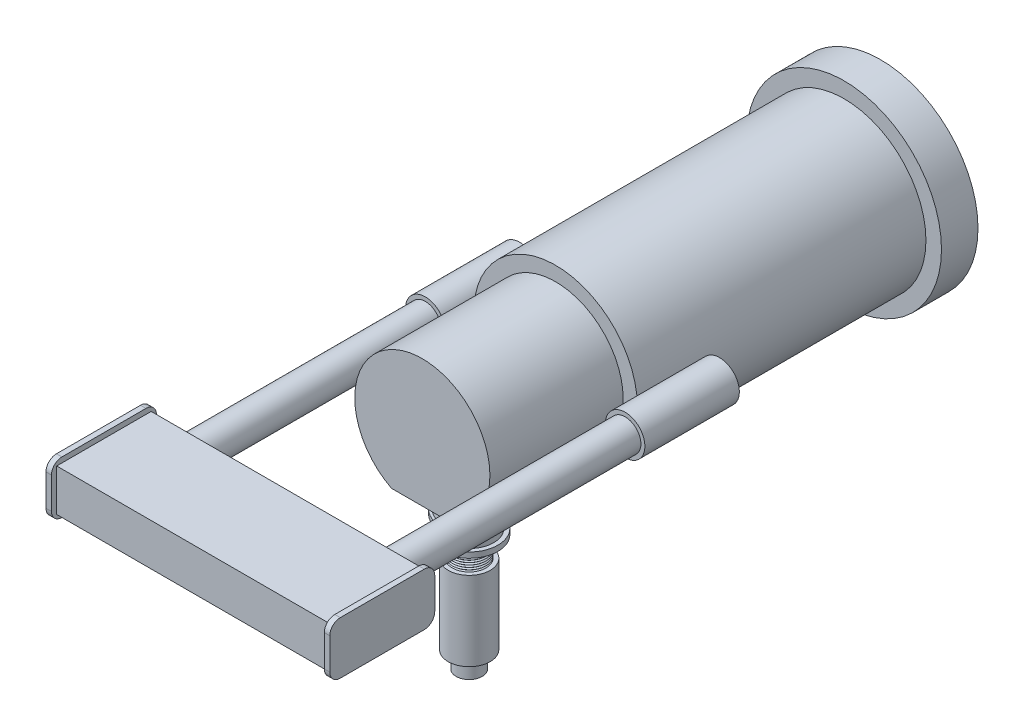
ISO-10303-21;
HEADER;
FILE_DESCRIPTION(('STEP AP214'),'2;1');
FILE_NAME('part.step','',(''),(''),'','','');
FILE_SCHEMA(('AUTOMOTIVE_DESIGN { 1 0 10303 214 1 1 1 1 }'));
ENDSEC;
DATA;
#1=APPLICATION_CONTEXT('core data for automotive mechanical design processes');
#2=APPLICATION_PROTOCOL_DEFINITION('international standard','automotive_design',2000,#1);
#3=PRODUCT_CONTEXT('',#1,'mechanical');
#4=PRODUCT('Part','Part','',(#3));
#5=PRODUCT_RELATED_PRODUCT_CATEGORY('part','',(#4));
#6=PRODUCT_DEFINITION_FORMATION('','',#4);
#7=PRODUCT_DEFINITION_CONTEXT('part definition',#1,'design');
#8=PRODUCT_DEFINITION('design','',#6,#7);
#9=PRODUCT_DEFINITION_SHAPE('','',#8);
#10=(LENGTH_UNIT() NAMED_UNIT(*) SI_UNIT(.MILLI.,.METRE.));
#11=(NAMED_UNIT(*) PLANE_ANGLE_UNIT() SI_UNIT($,.RADIAN.));
#12=(NAMED_UNIT(*) SI_UNIT($,.STERADIAN.) SOLID_ANGLE_UNIT());
#13=UNCERTAINTY_MEASURE_WITH_UNIT(LENGTH_MEASURE(1.E-05),#10,'distance_accuracy_value','');
#14=(GEOMETRIC_REPRESENTATION_CONTEXT(3) GLOBAL_UNCERTAINTY_ASSIGNED_CONTEXT((#13)) GLOBAL_UNIT_ASSIGNED_CONTEXT((#10,
#11,#12)) REPRESENTATION_CONTEXT('',''));
#15=CARTESIAN_POINT('',(0.,0.,0.));
#16=DIRECTION('',(0.,0.,1.));
#17=DIRECTION('',(1.,0.,0.));
#18=AXIS2_PLACEMENT_3D('',#15,#16,#17);
#19=CARTESIAN_POINT('',(-85.852,9.525,412.75));
#20=DIRECTION('',(1.,0.,0.));
#21=DIRECTION('',(0.,0.,1.));
#22=AXIS2_PLACEMENT_3D('',#19,#20,#21);
#23=CYLINDRICAL_SURFACE('',#22,6.35000000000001);
#24=CARTESIAN_POINT('',(-82.55,9.525,412.75));
#25=DIRECTION('',(1.,0.,0.));
#26=DIRECTION('',(0.,0.,1.));
#27=AXIS2_PLACEMENT_3D('',#24,#25,#26);
#28=CIRCLE('',#27,6.35000000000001);
#29=CARTESIAN_POINT('',(-82.55,15.875,412.75));
#30=VERTEX_POINT('',#29);
#31=CARTESIAN_POINT('',(-82.55,9.525,419.1));
#32=VERTEX_POINT('',#31);
#33=EDGE_CURVE('E456',#30,#32,#28,.T.);
#34=ORIENTED_EDGE('',*,*,#33,.F.);
#35=DIRECTION('',(1.,0.,0.));
#36=VECTOR('',#35,1.);
#37=CARTESIAN_POINT('',(-85.852,15.875,412.75));
#38=LINE('',#37,#36);
#39=CARTESIAN_POINT('',(-85.852,15.875,412.75));
#40=VERTEX_POINT('',#39);
#41=EDGE_CURVE('E499',#40,#30,#38,.T.);
#42=ORIENTED_EDGE('',*,*,#41,.F.);
#43=CARTESIAN_POINT('',(-85.852,9.525,412.75));
#44=DIRECTION('',(1.,0.,0.));
#45=DIRECTION('',(0.,0.,1.));
#46=AXIS2_PLACEMENT_3D('',#43,#44,#45);
#47=CIRCLE('',#46,6.35000000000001);
#48=CARTESIAN_POINT('',(-85.852,9.525,419.1));
#49=VERTEX_POINT('',#48);
#50=EDGE_CURVE('E461',#40,#49,#47,.T.);
#51=ORIENTED_EDGE('',*,*,#50,.T.);
#52=DIRECTION('',(1.,0.,0.));
#53=VECTOR('',#52,1.);
#54=CARTESIAN_POINT('',(-85.852,9.525,419.1));
#55=LINE('',#54,#53);
#56=EDGE_CURVE('E12',#49,#32,#55,.T.);
#57=ORIENTED_EDGE('',*,*,#56,.T.);
#58=EDGE_LOOP('',(#34,#42,#51,#57));
#59=FACE_BOUND('',#58,.T.);
#60=ADVANCED_FACE('F384',(#59),#23,.T.);
#61=CARTESIAN_POINT('',(-85.852,9.525,419.1));
#62=DIRECTION('',(0.,0.,-1.));
#63=DIRECTION('',(1.,0.,0.));
#64=AXIS2_PLACEMENT_3D('',#61,#62,#63);
#65=PLANE('',#64);
#66=DIRECTION('',(0.,-1.,0.));
#67=VECTOR('',#66,1.);
#68=CARTESIAN_POINT('',(-82.55,9.525,419.1));
#69=LINE('',#68,#67);
#70=CARTESIAN_POINT('',(-82.55,-9.525,419.1));
#71=VERTEX_POINT('',#70);
#72=EDGE_CURVE('E447',#32,#71,#69,.T.);
#73=ORIENTED_EDGE('',*,*,#72,.F.);
#74=ORIENTED_EDGE('',*,*,#56,.F.);
#75=DIRECTION('',(0.,-1.,0.));
#76=VECTOR('',#75,1.);
#77=CARTESIAN_POINT('',(-85.852,9.525,419.1));
#78=LINE('',#77,#76);
#79=CARTESIAN_POINT('',(-85.852,-9.525,419.1));
#80=VERTEX_POINT('',#79);
#81=EDGE_CURVE('E481',#49,#80,#78,.T.);
#82=ORIENTED_EDGE('',*,*,#81,.T.);
#83=DIRECTION('',(1.,0.,0.));
#84=VECTOR('',#83,1.);
#85=CARTESIAN_POINT('',(-85.852,-9.525,419.1));
#86=LINE('',#85,#84);
#87=EDGE_CURVE('E391',#80,#71,#86,.T.);
#88=ORIENTED_EDGE('',*,*,#87,.T.);
#89=EDGE_LOOP('',(#73,#74,#82,#88));
#90=FACE_BOUND('',#89,.T.);
#91=ADVANCED_FACE('F448',(#90),#65,.F.);
#92=CARTESIAN_POINT('',(-85.852,-9.525,412.75));
#93=DIRECTION('',(1.,0.,0.));
#94=DIRECTION('',(0.,0.,1.));
#95=AXIS2_PLACEMENT_3D('',#92,#93,#94);
#96=CYLINDRICAL_SURFACE('',#95,6.35000000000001);
#97=CARTESIAN_POINT('',(-82.55,-9.525,412.75));
#98=DIRECTION('',(1.,0.,0.));
#99=DIRECTION('',(0.,0.,-1.));
#100=AXIS2_PLACEMENT_3D('',#97,#98,#99);
#101=CIRCLE('',#100,6.35000000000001);
#102=CARTESIAN_POINT('',(-82.55,-15.875,412.75));
#103=VERTEX_POINT('',#102);
#104=EDGE_CURVE('E455',#71,#103,#101,.T.);
#105=ORIENTED_EDGE('',*,*,#104,.F.);
#106=ORIENTED_EDGE('',*,*,#87,.F.);
#107=CARTESIAN_POINT('',(-85.852,-9.525,412.75));
#108=DIRECTION('',(1.,0.,0.));
#109=DIRECTION('',(0.,0.,-1.));
#110=AXIS2_PLACEMENT_3D('',#107,#108,#109);
#111=CIRCLE('',#110,6.35000000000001);
#112=CARTESIAN_POINT('',(-85.852,-15.875,412.75));
#113=VERTEX_POINT('',#112);
#114=EDGE_CURVE('E483',#80,#113,#111,.T.);
#115=ORIENTED_EDGE('',*,*,#114,.T.);
#116=DIRECTION('',(1.,0.,0.));
#117=VECTOR('',#116,1.);
#118=CARTESIAN_POINT('',(-85.852,-15.875,412.75));
#119=LINE('',#118,#117);
#120=EDGE_CURVE('E513',#113,#103,#119,.T.);
#121=ORIENTED_EDGE('',*,*,#120,.T.);
#122=EDGE_LOOP('',(#105,#106,#115,#121));
#123=FACE_BOUND('',#122,.T.);
#124=ADVANCED_FACE('F517',(#123),#96,.T.);
#125=CARTESIAN_POINT('',(-85.852,-15.875,412.75));
#126=DIRECTION('',(0.,1.,0.));
#127=DIRECTION('',(0.,0.,1.));
#128=AXIS2_PLACEMENT_3D('',#125,#126,#127);
#129=PLANE('',#128);
#130=DIRECTION('',(0.,0.,-1.));
#131=VECTOR('',#130,1.);
#132=CARTESIAN_POINT('',(-82.55,-15.875,412.75));
#133=LINE('',#132,#131);
#134=CARTESIAN_POINT('',(-82.55,-15.875,361.95));
#135=VERTEX_POINT('',#134);
#136=EDGE_CURVE('E468',#103,#135,#133,.T.);
#137=ORIENTED_EDGE('',*,*,#136,.F.);
#138=ORIENTED_EDGE('',*,*,#120,.F.);
#139=DIRECTION('',(0.,0.,-1.));
#140=VECTOR('',#139,1.);
#141=CARTESIAN_POINT('',(-85.852,-15.875,412.75));
#142=LINE('',#141,#140);
#143=CARTESIAN_POINT('',(-85.852,-15.875,361.95));
#144=VERTEX_POINT('',#143);
#145=EDGE_CURVE('E486',#113,#144,#142,.T.);
#146=ORIENTED_EDGE('',*,*,#145,.T.);
#147=DIRECTION('',(1.,0.,0.));
#148=VECTOR('',#147,1.);
#149=CARTESIAN_POINT('',(-85.852,-15.875,361.95));
#150=LINE('',#149,#148);
#151=EDGE_CURVE('E510',#144,#135,#150,.T.);
#152=ORIENTED_EDGE('',*,*,#151,.T.);
#153=EDGE_LOOP('',(#137,#138,#146,#152));
#154=FACE_BOUND('',#153,.T.);
#155=ADVANCED_FACE('F519',(#154),#129,.F.);
#156=CARTESIAN_POINT('',(-85.852,-9.525,361.95));
#157=DIRECTION('',(1.,0.,0.));
#158=DIRECTION('',(0.,0.,1.));
#159=AXIS2_PLACEMENT_3D('',#156,#157,#158);
#160=CYLINDRICAL_SURFACE('',#159,6.35000000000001);
#161=CARTESIAN_POINT('',(-82.55,-9.525,361.95));
#162=DIRECTION('',(1.,0.,0.));
#163=DIRECTION('',(0.,0.,1.));
#164=AXIS2_PLACEMENT_3D('',#161,#162,#163);
#165=CIRCLE('',#164,6.35000000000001);
#166=CARTESIAN_POINT('',(-82.55,-9.525,355.6));
#167=VERTEX_POINT('',#166);
#168=EDGE_CURVE('E471',#135,#167,#165,.T.);
#169=ORIENTED_EDGE('',*,*,#168,.F.);
#170=ORIENTED_EDGE('',*,*,#151,.F.);
#171=CARTESIAN_POINT('',(-85.852,-9.525,361.95));
#172=DIRECTION('',(1.,0.,0.));
#173=DIRECTION('',(0.,0.,1.));
#174=AXIS2_PLACEMENT_3D('',#171,#172,#173);
#175=CIRCLE('',#174,6.35000000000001);
#176=CARTESIAN_POINT('',(-85.852,-9.525,355.6));
#177=VERTEX_POINT('',#176);
#178=EDGE_CURVE('E489',#144,#177,#175,.T.);
#179=ORIENTED_EDGE('',*,*,#178,.T.);
#180=DIRECTION('',(1.,0.,0.));
#181=VECTOR('',#180,1.);
#182=CARTESIAN_POINT('',(-85.852,-9.525,355.6));
#183=LINE('',#182,#181);
#184=EDGE_CURVE('E507',#177,#167,#183,.T.);
#185=ORIENTED_EDGE('',*,*,#184,.T.);
#186=EDGE_LOOP('',(#169,#170,#179,#185));
#187=FACE_BOUND('',#186,.T.);
#188=ADVANCED_FACE('F522',(#187),#160,.T.);
#189=CARTESIAN_POINT('',(-85.852,-9.525,355.6));
#190=DIRECTION('',(0.,0.,1.));
#191=DIRECTION('',(-1.,0.,0.));
#192=AXIS2_PLACEMENT_3D('',#189,#190,#191);
#193=PLANE('',#192);
#194=DIRECTION('',(0.,1.,0.));
#195=VECTOR('',#194,1.);
#196=CARTESIAN_POINT('',(-82.55,-9.525,355.6));
#197=LINE('',#196,#195);
#198=CARTESIAN_POINT('',(-82.55,9.525,355.6));
#199=VERTEX_POINT('',#198);
#200=EDGE_CURVE('E474',#167,#199,#197,.T.);
#201=ORIENTED_EDGE('',*,*,#200,.F.);
#202=ORIENTED_EDGE('',*,*,#184,.F.);
#203=DIRECTION('',(0.,1.,0.));
#204=VECTOR('',#203,1.);
#205=CARTESIAN_POINT('',(-85.852,-9.525,355.6));
#206=LINE('',#205,#204);
#207=CARTESIAN_POINT('',(-85.852,9.525,355.6));
#208=VERTEX_POINT('',#207);
#209=EDGE_CURVE('E492',#177,#208,#206,.T.);
#210=ORIENTED_EDGE('',*,*,#209,.T.);
#211=DIRECTION('',(1.,0.,0.));
#212=VECTOR('',#211,1.);
#213=CARTESIAN_POINT('',(-85.852,9.525,355.6));
#214=LINE('',#213,#212);
#215=EDGE_CURVE('E504',#208,#199,#214,.T.);
#216=ORIENTED_EDGE('',*,*,#215,.T.);
#217=EDGE_LOOP('',(#201,#202,#210,#216));
#218=FACE_BOUND('',#217,.T.);
#219=ADVANCED_FACE('F525',(#218),#193,.F.);
#220=CARTESIAN_POINT('',(-85.852,9.525,361.95));
#221=DIRECTION('',(1.,0.,0.));
#222=DIRECTION('',(0.,0.,1.));
#223=AXIS2_PLACEMENT_3D('',#220,#221,#222);
#224=CYLINDRICAL_SURFACE('',#223,6.35000000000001);
#225=CARTESIAN_POINT('',(-82.55,9.525,361.95));
#226=DIRECTION('',(1.,0.,0.));
#227=DIRECTION('',(0.,0.,1.));
#228=AXIS2_PLACEMENT_3D('',#225,#226,#227);
#229=CIRCLE('',#228,6.35000000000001);
#230=CARTESIAN_POINT('',(-82.55,15.875,361.95));
#231=VERTEX_POINT('',#230);
#232=EDGE_CURVE('E477',#199,#231,#229,.T.);
#233=ORIENTED_EDGE('',*,*,#232,.F.);
#234=ORIENTED_EDGE('',*,*,#215,.F.);
#235=CARTESIAN_POINT('',(-85.852,9.525,361.95));
#236=DIRECTION('',(1.,0.,0.));
#237=DIRECTION('',(0.,0.,1.));
#238=AXIS2_PLACEMENT_3D('',#235,#236,#237);
#239=CIRCLE('',#238,6.35000000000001);
#240=CARTESIAN_POINT('',(-85.852,15.875,361.95));
#241=VERTEX_POINT('',#240);
#242=EDGE_CURVE('E495',#208,#241,#239,.T.);
#243=ORIENTED_EDGE('',*,*,#242,.T.);
#244=DIRECTION('',(1.,0.,0.));
#245=VECTOR('',#244,1.);
#246=CARTESIAN_POINT('',(-85.852,15.875,361.95));
#247=LINE('',#246,#245);
#248=EDGE_CURVE('E501',#241,#231,#247,.T.);
#249=ORIENTED_EDGE('',*,*,#248,.T.);
#250=EDGE_LOOP('',(#233,#234,#243,#249));
#251=FACE_BOUND('',#250,.T.);
#252=ADVANCED_FACE('F528',(#251),#224,.T.);
#253=CARTESIAN_POINT('',(-85.852,15.875,361.95));
#254=DIRECTION('',(0.,-1.,0.));
#255=DIRECTION('',(0.,0.,-1.));
#256=AXIS2_PLACEMENT_3D('',#253,#254,#255);
#257=PLANE('',#256);
#258=DIRECTION('',(0.,0.,1.));
#259=VECTOR('',#258,1.);
#260=CARTESIAN_POINT('',(-82.55,15.875,361.95));
#261=LINE('',#260,#259);
#262=EDGE_CURVE('E464',#231,#30,#261,.T.);
#263=ORIENTED_EDGE('',*,*,#262,.F.);
#264=ORIENTED_EDGE('',*,*,#248,.F.);
#265=DIRECTION('',(0.,0.,1.));
#266=VECTOR('',#265,1.);
#267=CARTESIAN_POINT('',(-85.852,15.875,361.95));
#268=LINE('',#267,#266);
#269=EDGE_CURVE('E398',#241,#40,#268,.T.);
#270=ORIENTED_EDGE('',*,*,#269,.T.);
#271=ORIENTED_EDGE('',*,*,#41,.T.);
#272=EDGE_LOOP('',(#263,#264,#270,#271));
#273=FACE_BOUND('',#272,.T.);
#274=ADVANCED_FACE('F529',(#273),#257,.F.);
#275=CARTESIAN_POINT('',(-85.852,9.525,412.75));
#276=DIRECTION('',(1.,0.,0.));
#277=DIRECTION('',(0.,0.,1.));
#278=AXIS2_PLACEMENT_3D('',#275,#276,#277);
#279=PLANE('',#278);
#280=ORIENTED_EDGE('',*,*,#50,.F.);
#281=ORIENTED_EDGE('',*,*,#269,.F.);
#282=ORIENTED_EDGE('',*,*,#242,.F.);
#283=ORIENTED_EDGE('',*,*,#209,.F.);
#284=ORIENTED_EDGE('',*,*,#178,.F.);
#285=ORIENTED_EDGE('',*,*,#145,.F.);
#286=ORIENTED_EDGE('',*,*,#114,.F.);
#287=ORIENTED_EDGE('',*,*,#81,.F.);
#288=EDGE_LOOP('',(#280,#281,#282,#283,#284,#285,#286,#287));
#289=FACE_BOUND('',#288,.T.);
#290=ADVANCED_FACE('F531',(#289),#279,.F.);
#291=CARTESIAN_POINT('',(-82.55,9.525,412.75));
#292=DIRECTION('',(1.,0.,0.));
#293=DIRECTION('',(0.,0.,1.));
#294=AXIS2_PLACEMENT_3D('',#291,#292,#293);
#295=PLANE('',#294);
#296=ORIENTED_EDGE('',*,*,#33,.T.);
#297=ORIENTED_EDGE('',*,*,#72,.T.);
#298=ORIENTED_EDGE('',*,*,#104,.T.);
#299=ORIENTED_EDGE('',*,*,#136,.T.);
#300=ORIENTED_EDGE('',*,*,#168,.T.);
#301=ORIENTED_EDGE('',*,*,#200,.T.);
#302=ORIENTED_EDGE('',*,*,#232,.T.);
#303=ORIENTED_EDGE('',*,*,#262,.T.);
#304=EDGE_LOOP('',(#296,#297,#298,#299,#300,#301,#302,#303));
#305=FACE_BOUND('',#304,.T.);
#306=ADVANCED_FACE('F462',(#305),#295,.T.);
#307=CLOSED_SHELL('',(#60,#91,#124,#155,#188,#219,#252,#274,#290,#306));
#308=MANIFOLD_SOLID_BREP('B2',#307);
#309=CARTESIAN_POINT('',(-60.452,0.,358.775));
#310=DIRECTION('',(0.,0.,-1.));
#311=DIRECTION('',(1.,0.,0.));
#312=AXIS2_PLACEMENT_3D('',#309,#310,#311);
#313=CYLINDRICAL_SURFACE('',#312,9.52500000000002);
#314=CARTESIAN_POINT('',(-60.452,0.,358.775));
#315=DIRECTION('',(0.,0.,-1.));
#316=DIRECTION('',(-1.,0.,0.));
#317=AXIS2_PLACEMENT_3D('',#314,#315,#316);
#318=CIRCLE('',#317,9.52500000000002);
#319=CARTESIAN_POINT('',(-69.977,0.,358.775));
#320=VERTEX_POINT('',#319);
#321=EDGE_CURVE('E383',#320,#320,#318,.T.);
#322=ORIENTED_EDGE('',*,*,#321,.T.);
#323=EDGE_LOOP('',(#322));
#324=FACE_BOUND('',#323,.T.);
#325=CARTESIAN_POINT('',(-60.452,0.,215.011));
#326=DIRECTION('',(0.,0.,-1.));
#327=DIRECTION('',(-1.,0.,0.));
#328=AXIS2_PLACEMENT_3D('',#325,#326,#327);
#329=CIRCLE('',#328,9.52500000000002);
#330=CARTESIAN_POINT('',(-69.977,0.,215.011));
#331=VERTEX_POINT('',#330);
#332=EDGE_CURVE('E606',#331,#331,#329,.T.);
#333=ORIENTED_EDGE('',*,*,#332,.F.);
#334=EDGE_LOOP('',(#333));
#335=FACE_BOUND('',#334,.T.);
#336=ADVANCED_FACE('F600',(#324,#335),#313,.T.);
#337=CARTESIAN_POINT('',(-60.452,0.,358.775));
#338=DIRECTION('',(0.,0.,1.));
#339=DIRECTION('',(-1.,0.,0.));
#340=AXIS2_PLACEMENT_3D('',#337,#338,#339);
#341=PLANE('',#340);
#342=ORIENTED_EDGE('',*,*,#321,.F.);
#343=EDGE_LOOP('',(#342));
#344=FACE_BOUND('',#343,.T.);
#345=ADVANCED_FACE('F615',(#344),#341,.T.);
#346=CARTESIAN_POINT('',(-60.452,0.,215.011));
#347=DIRECTION('',(0.,0.,1.));
#348=DIRECTION('',(-1.,0.,0.));
#349=AXIS2_PLACEMENT_3D('',#346,#347,#348);
#350=PLANE('',#349);
#351=ORIENTED_EDGE('',*,*,#332,.T.);
#352=EDGE_LOOP('',(#351));
#353=FACE_BOUND('',#352,.T.);
#354=ADVANCED_FACE('F612',(#353),#350,.F.);
#355=CLOSED_SHELL('',(#336,#345,#354));
#356=MANIFOLD_SOLID_BREP('B6',#355);
#357=CARTESIAN_POINT('',(-60.452,0.,215.011));
#358=DIRECTION('',(0.,0.,-1.));
#359=DIRECTION('',(1.,0.,0.));
#360=AXIS2_PLACEMENT_3D('',#357,#358,#359);
#361=CYLINDRICAL_SURFACE('',#360,11.938);
#362=CARTESIAN_POINT('',(-60.452,0.,215.011));
#363=DIRECTION('',(0.,0.,-1.));
#364=DIRECTION('',(-1.,0.,0.));
#365=AXIS2_PLACEMENT_3D('',#362,#363,#364);
#366=CIRCLE('',#365,11.938);
#367=CARTESIAN_POINT('',(-72.39,0.,215.011));
#368=VERTEX_POINT('',#367);
#369=EDGE_CURVE('E599',#368,#368,#366,.T.);
#370=ORIENTED_EDGE('',*,*,#369,.T.);
#371=EDGE_LOOP('',(#370));
#372=FACE_BOUND('',#371,.T.);
#373=CARTESIAN_POINT('',(-60.452,0.,157.861));
#374=DIRECTION('',(0.,0.,-1.));
#375=DIRECTION('',(-1.,0.,0.));
#376=AXIS2_PLACEMENT_3D('',#373,#374,#375);
#377=CIRCLE('',#376,11.938);
#378=CARTESIAN_POINT('',(-72.39,0.,157.861));
#379=VERTEX_POINT('',#378);
#380=EDGE_CURVE('E651',#379,#379,#377,.T.);
#381=ORIENTED_EDGE('',*,*,#380,.F.);
#382=EDGE_LOOP('',(#381));
#383=FACE_BOUND('',#382,.T.);
#384=ADVANCED_FACE('F645',(#372,#383),#361,.T.);
#385=CARTESIAN_POINT('',(-60.452,0.,215.011));
#386=DIRECTION('',(0.,0.,1.));
#387=DIRECTION('',(-1.,0.,0.));
#388=AXIS2_PLACEMENT_3D('',#385,#386,#387);
#389=PLANE('',#388);
#390=ORIENTED_EDGE('',*,*,#369,.F.);
#391=EDGE_LOOP('',(#390));
#392=FACE_BOUND('',#391,.T.);
#393=ADVANCED_FACE('F660',(#392),#389,.T.);
#394=CARTESIAN_POINT('',(-60.452,0.,157.861));
#395=DIRECTION('',(0.,0.,1.));
#396=DIRECTION('',(-1.,0.,0.));
#397=AXIS2_PLACEMENT_3D('',#394,#395,#396);
#398=PLANE('',#397);
#399=ORIENTED_EDGE('',*,*,#380,.T.);
#400=EDGE_LOOP('',(#399));
#401=FACE_BOUND('',#400,.T.);
#402=ADVANCED_FACE('F657',(#401),#398,.F.);
#403=CLOSED_SHELL('',(#384,#393,#402));
#404=MANIFOLD_SOLID_BREP('B378',#403);
#405=CARTESIAN_POINT('',(85.852,9.525,412.75));
#406=DIRECTION('',(-1.,0.,0.));
#407=DIRECTION('',(0.,0.,1.));
#408=AXIS2_PLACEMENT_3D('',#405,#406,#407);
#409=CYLINDRICAL_SURFACE('',#408,6.35000000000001);
#410=CARTESIAN_POINT('',(82.55,9.525,412.75));
#411=DIRECTION('',(1.,0.,0.));
#412=DIRECTION('',(0.,0.,1.));
#413=AXIS2_PLACEMENT_3D('',#410,#411,#412);
#414=CIRCLE('',#413,6.35000000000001);
#415=CARTESIAN_POINT('',(82.55,15.875,412.75));
#416=VERTEX_POINT('',#415);
#417=CARTESIAN_POINT('',(82.55,9.525,419.1));
#418=VERTEX_POINT('',#417);
#419=EDGE_CURVE('E758',#416,#418,#414,.T.);
#420=ORIENTED_EDGE('',*,*,#419,.T.);
#421=DIRECTION('',(-1.,0.,0.));
#422=VECTOR('',#421,1.);
#423=CARTESIAN_POINT('',(85.852,9.525,419.1));
#424=LINE('',#423,#422);
#425=CARTESIAN_POINT('',(85.852,9.525,419.1));
#426=VERTEX_POINT('',#425);
#427=EDGE_CURVE('E643',#426,#418,#424,.T.);
#428=ORIENTED_EDGE('',*,*,#427,.F.);
#429=CARTESIAN_POINT('',(85.852,9.525,412.75));
#430=DIRECTION('',(1.,0.,0.));
#431=DIRECTION('',(0.,0.,1.));
#432=AXIS2_PLACEMENT_3D('',#429,#430,#431);
#433=CIRCLE('',#432,6.35000000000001);
#434=CARTESIAN_POINT('',(85.852,15.875,412.75));
#435=VERTEX_POINT('',#434);
#436=EDGE_CURVE('E785',#435,#426,#433,.T.);
#437=ORIENTED_EDGE('',*,*,#436,.F.);
#438=DIRECTION('',(-1.,0.,0.));
#439=VECTOR('',#438,1.);
#440=CARTESIAN_POINT('',(85.852,15.875,412.75));
#441=LINE('',#440,#439);
#442=EDGE_CURVE('E771',#435,#416,#441,.T.);
#443=ORIENTED_EDGE('',*,*,#442,.T.);
#444=EDGE_LOOP('',(#420,#428,#437,#443));
#445=FACE_BOUND('',#444,.T.);
#446=ADVANCED_FACE('F690',(#445),#409,.T.);
#447=CARTESIAN_POINT('',(85.852,9.525,419.1));
#448=DIRECTION('',(0.,0.,-1.));
#449=DIRECTION('',(-1.,0.,0.));
#450=AXIS2_PLACEMENT_3D('',#447,#448,#449);
#451=PLANE('',#450);
#452=DIRECTION('',(0.,-1.,0.));
#453=VECTOR('',#452,1.);
#454=CARTESIAN_POINT('',(82.55,9.525,419.1));
#455=LINE('',#454,#453);
#456=CARTESIAN_POINT('',(82.55,-9.525,419.1));
#457=VERTEX_POINT('',#456);
#458=EDGE_CURVE('E754',#418,#457,#455,.T.);
#459=ORIENTED_EDGE('',*,*,#458,.T.);
#460=DIRECTION('',(-1.,0.,0.));
#461=VECTOR('',#460,1.);
#462=CARTESIAN_POINT('',(85.852,-9.525,419.1));
#463=LINE('',#462,#461);
#464=CARTESIAN_POINT('',(85.852,-9.525,419.1));
#465=VERTEX_POINT('',#464);
#466=EDGE_CURVE('E697',#465,#457,#463,.T.);
#467=ORIENTED_EDGE('',*,*,#466,.F.);
#468=DIRECTION('',(0.,-1.,0.));
#469=VECTOR('',#468,1.);
#470=CARTESIAN_POINT('',(85.852,9.525,419.1));
#471=LINE('',#470,#469);
#472=EDGE_CURVE('E767',#426,#465,#471,.T.);
#473=ORIENTED_EDGE('',*,*,#472,.F.);
#474=ORIENTED_EDGE('',*,*,#427,.T.);
#475=EDGE_LOOP('',(#459,#467,#473,#474));
#476=FACE_BOUND('',#475,.T.);
#477=ADVANCED_FACE('F766',(#476),#451,.F.);
#478=CARTESIAN_POINT('',(85.852,-9.525,412.75));
#479=DIRECTION('',(-1.,0.,0.));
#480=DIRECTION('',(0.,0.,1.));
#481=AXIS2_PLACEMENT_3D('',#478,#479,#480);
#482=CYLINDRICAL_SURFACE('',#481,6.35000000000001);
#483=CARTESIAN_POINT('',(82.55,-9.525,412.75));
#484=DIRECTION('',(1.,0.,0.));
#485=DIRECTION('',(0.,0.,-1.));
#486=AXIS2_PLACEMENT_3D('',#483,#484,#485);
#487=CIRCLE('',#486,6.35000000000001);
#488=CARTESIAN_POINT('',(82.55,-15.875,412.75));
#489=VERTEX_POINT('',#488);
#490=EDGE_CURVE('E760',#457,#489,#487,.T.);
#491=ORIENTED_EDGE('',*,*,#490,.T.);
#492=DIRECTION('',(-1.,0.,0.));
#493=VECTOR('',#492,1.);
#494=CARTESIAN_POINT('',(85.852,-15.875,412.75));
#495=LINE('',#494,#493);
#496=CARTESIAN_POINT('',(85.852,-15.875,412.75));
#497=VERTEX_POINT('',#496);
#498=EDGE_CURVE('E811',#497,#489,#495,.T.);
#499=ORIENTED_EDGE('',*,*,#498,.F.);
#500=CARTESIAN_POINT('',(85.852,-9.525,412.75));
#501=DIRECTION('',(1.,0.,0.));
#502=DIRECTION('',(0.,0.,-1.));
#503=AXIS2_PLACEMENT_3D('',#500,#501,#502);
#504=CIRCLE('',#503,6.35000000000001);
#505=EDGE_CURVE('E788',#465,#497,#504,.T.);
#506=ORIENTED_EDGE('',*,*,#505,.F.);
#507=ORIENTED_EDGE('',*,*,#466,.T.);
#508=EDGE_LOOP('',(#491,#499,#506,#507));
#509=FACE_BOUND('',#508,.T.);
#510=ADVANCED_FACE('F815',(#509),#482,.T.);
#511=CARTESIAN_POINT('',(85.852,-15.875,412.75));
#512=DIRECTION('',(0.,1.,0.));
#513=DIRECTION('',(0.,0.,1.));
#514=AXIS2_PLACEMENT_3D('',#511,#512,#513);
#515=PLANE('',#514);
#516=DIRECTION('',(0.,0.,-1.));
#517=VECTOR('',#516,1.);
#518=CARTESIAN_POINT('',(82.55,-15.875,412.75));
#519=LINE('',#518,#517);
#520=CARTESIAN_POINT('',(82.55,-15.875,361.95));
#521=VERTEX_POINT('',#520);
#522=EDGE_CURVE('E775',#489,#521,#519,.T.);
#523=ORIENTED_EDGE('',*,*,#522,.T.);
#524=DIRECTION('',(-1.,0.,0.));
#525=VECTOR('',#524,1.);
#526=CARTESIAN_POINT('',(85.852,-15.875,361.95));
#527=LINE('',#526,#525);
#528=CARTESIAN_POINT('',(85.852,-15.875,361.95));
#529=VERTEX_POINT('',#528);
#530=EDGE_CURVE('E808',#529,#521,#527,.T.);
#531=ORIENTED_EDGE('',*,*,#530,.F.);
#532=DIRECTION('',(0.,0.,-1.));
#533=VECTOR('',#532,1.);
#534=CARTESIAN_POINT('',(85.852,-15.875,412.75));
#535=LINE('',#534,#533);
#536=EDGE_CURVE('E790',#497,#529,#535,.T.);
#537=ORIENTED_EDGE('',*,*,#536,.F.);
#538=ORIENTED_EDGE('',*,*,#498,.T.);
#539=EDGE_LOOP('',(#523,#531,#537,#538));
#540=FACE_BOUND('',#539,.T.);
#541=ADVANCED_FACE('F823',(#540),#515,.F.);
#542=CARTESIAN_POINT('',(85.852,-9.525,361.95));
#543=DIRECTION('',(-1.,0.,0.));
#544=DIRECTION('',(0.,0.,1.));
#545=AXIS2_PLACEMENT_3D('',#542,#543,#544);
#546=CYLINDRICAL_SURFACE('',#545,6.35000000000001);
#547=CARTESIAN_POINT('',(82.55,-9.525,361.95));
#548=DIRECTION('',(1.,0.,0.));
#549=DIRECTION('',(0.,0.,1.));
#550=AXIS2_PLACEMENT_3D('',#547,#548,#549);
#551=CIRCLE('',#550,6.35000000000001);
#552=CARTESIAN_POINT('',(82.55,-9.525,355.6));
#553=VERTEX_POINT('',#552);
#554=EDGE_CURVE('E777',#521,#553,#551,.T.);
#555=ORIENTED_EDGE('',*,*,#554,.T.);
#556=DIRECTION('',(-1.,0.,0.));
#557=VECTOR('',#556,1.);
#558=CARTESIAN_POINT('',(85.852,-9.525,355.6));
#559=LINE('',#558,#557);
#560=CARTESIAN_POINT('',(85.852,-9.525,355.6));
#561=VERTEX_POINT('',#560);
#562=EDGE_CURVE('E805',#561,#553,#559,.T.);
#563=ORIENTED_EDGE('',*,*,#562,.F.);
#564=CARTESIAN_POINT('',(85.852,-9.525,361.95));
#565=DIRECTION('',(1.,0.,0.));
#566=DIRECTION('',(0.,0.,1.));
#567=AXIS2_PLACEMENT_3D('',#564,#565,#566);
#568=CIRCLE('',#567,6.35000000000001);
#569=EDGE_CURVE('E792',#529,#561,#568,.T.);
#570=ORIENTED_EDGE('',*,*,#569,.F.);
#571=ORIENTED_EDGE('',*,*,#530,.T.);
#572=EDGE_LOOP('',(#555,#563,#570,#571));
#573=FACE_BOUND('',#572,.T.);
#574=ADVANCED_FACE('F826',(#573),#546,.T.);
#575=CARTESIAN_POINT('',(85.852,-9.525,355.6));
#576=DIRECTION('',(0.,0.,1.));
#577=DIRECTION('',(1.,0.,0.));
#578=AXIS2_PLACEMENT_3D('',#575,#576,#577);
#579=PLANE('',#578);
#580=DIRECTION('',(0.,1.,0.));
#581=VECTOR('',#580,1.);
#582=CARTESIAN_POINT('',(82.55,-9.525,355.6));
#583=LINE('',#582,#581);
#584=CARTESIAN_POINT('',(82.55,9.525,355.6));
#585=VERTEX_POINT('',#584);
#586=EDGE_CURVE('E779',#553,#585,#583,.T.);
#587=ORIENTED_EDGE('',*,*,#586,.T.);
#588=DIRECTION('',(-1.,0.,0.));
#589=VECTOR('',#588,1.);
#590=CARTESIAN_POINT('',(85.852,9.525,355.6));
#591=LINE('',#590,#589);
#592=CARTESIAN_POINT('',(85.852,9.525,355.6));
#593=VERTEX_POINT('',#592);
#594=EDGE_CURVE('E802',#593,#585,#591,.T.);
#595=ORIENTED_EDGE('',*,*,#594,.F.);
#596=DIRECTION('',(0.,1.,0.));
#597=VECTOR('',#596,1.);
#598=CARTESIAN_POINT('',(85.852,-9.525,355.6));
#599=LINE('',#598,#597);
#600=EDGE_CURVE('E794',#561,#593,#599,.T.);
#601=ORIENTED_EDGE('',*,*,#600,.F.);
#602=ORIENTED_EDGE('',*,*,#562,.T.);
#603=EDGE_LOOP('',(#587,#595,#601,#602));
#604=FACE_BOUND('',#603,.T.);
#605=ADVANCED_FACE('F831',(#604),#579,.F.);
#606=CARTESIAN_POINT('',(85.852,9.525,361.95));
#607=DIRECTION('',(-1.,0.,0.));
#608=DIRECTION('',(0.,0.,1.));
#609=AXIS2_PLACEMENT_3D('',#606,#607,#608);
#610=CYLINDRICAL_SURFACE('',#609,6.35000000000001);
#611=CARTESIAN_POINT('',(82.55,9.525,361.95));
#612=DIRECTION('',(1.,0.,0.));
#613=DIRECTION('',(0.,0.,1.));
#614=AXIS2_PLACEMENT_3D('',#611,#612,#613);
#615=CIRCLE('',#614,6.35000000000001);
#616=CARTESIAN_POINT('',(82.55,15.875,361.95));
#617=VERTEX_POINT('',#616);
#618=EDGE_CURVE('E781',#585,#617,#615,.T.);
#619=ORIENTED_EDGE('',*,*,#618,.T.);
#620=DIRECTION('',(-1.,0.,0.));
#621=VECTOR('',#620,1.);
#622=CARTESIAN_POINT('',(85.852,15.875,361.95));
#623=LINE('',#622,#621);
#624=CARTESIAN_POINT('',(85.852,15.875,361.95));
#625=VERTEX_POINT('',#624);
#626=EDGE_CURVE('E799',#625,#617,#623,.T.);
#627=ORIENTED_EDGE('',*,*,#626,.F.);
#628=CARTESIAN_POINT('',(85.852,9.525,361.95));
#629=DIRECTION('',(1.,0.,0.));
#630=DIRECTION('',(0.,0.,1.));
#631=AXIS2_PLACEMENT_3D('',#628,#629,#630);
#632=CIRCLE('',#631,6.35000000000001);
#633=EDGE_CURVE('E709',#593,#625,#632,.T.);
#634=ORIENTED_EDGE('',*,*,#633,.F.);
#635=ORIENTED_EDGE('',*,*,#594,.T.);
#636=EDGE_LOOP('',(#619,#627,#634,#635));
#637=FACE_BOUND('',#636,.T.);
#638=ADVANCED_FACE('F834',(#637),#610,.T.);
#639=CARTESIAN_POINT('',(85.852,15.875,361.95));
#640=DIRECTION('',(0.,-1.,0.));
#641=DIRECTION('',(0.,0.,-1.));
#642=AXIS2_PLACEMENT_3D('',#639,#640,#641);
#643=PLANE('',#642);
#644=DIRECTION('',(0.,0.,1.));
#645=VECTOR('',#644,1.);
#646=CARTESIAN_POINT('',(82.55,15.875,361.95));
#647=LINE('',#646,#645);
#648=EDGE_CURVE('E783',#617,#416,#647,.T.);
#649=ORIENTED_EDGE('',*,*,#648,.T.);
#650=ORIENTED_EDGE('',*,*,#442,.F.);
#651=DIRECTION('',(0.,0.,1.));
#652=VECTOR('',#651,1.);
#653=CARTESIAN_POINT('',(85.852,15.875,361.95));
#654=LINE('',#653,#652);
#655=EDGE_CURVE('E704',#625,#435,#654,.T.);
#656=ORIENTED_EDGE('',*,*,#655,.F.);
#657=ORIENTED_EDGE('',*,*,#626,.T.);
#658=EDGE_LOOP('',(#649,#650,#656,#657));
#659=FACE_BOUND('',#658,.T.);
#660=ADVANCED_FACE('F836',(#659),#643,.F.);
#661=CARTESIAN_POINT('',(85.852,9.525,412.75));
#662=DIRECTION('',(-1.,0.,0.));
#663=DIRECTION('',(0.,0.,1.));
#664=AXIS2_PLACEMENT_3D('',#661,#662,#663);
#665=PLANE('',#664);
#666=ORIENTED_EDGE('',*,*,#436,.T.);
#667=ORIENTED_EDGE('',*,*,#472,.T.);
#668=ORIENTED_EDGE('',*,*,#505,.T.);
#669=ORIENTED_EDGE('',*,*,#536,.T.);
#670=ORIENTED_EDGE('',*,*,#569,.T.);
#671=ORIENTED_EDGE('',*,*,#600,.T.);
#672=ORIENTED_EDGE('',*,*,#633,.T.);
#673=ORIENTED_EDGE('',*,*,#655,.T.);
#674=EDGE_LOOP('',(#666,#667,#668,#669,#670,#671,#672,#673));
#675=FACE_BOUND('',#674,.T.);
#676=ADVANCED_FACE('F818',(#675),#665,.F.);
#677=CARTESIAN_POINT('',(82.55,9.525,412.75));
#678=DIRECTION('',(-1.,0.,0.));
#679=DIRECTION('',(0.,0.,1.));
#680=AXIS2_PLACEMENT_3D('',#677,#678,#679);
#681=PLANE('',#680);
#682=ORIENTED_EDGE('',*,*,#419,.F.);
#683=ORIENTED_EDGE('',*,*,#648,.F.);
#684=ORIENTED_EDGE('',*,*,#618,.F.);
#685=ORIENTED_EDGE('',*,*,#586,.F.);
#686=ORIENTED_EDGE('',*,*,#554,.F.);
#687=ORIENTED_EDGE('',*,*,#522,.F.);
#688=ORIENTED_EDGE('',*,*,#490,.F.);
#689=ORIENTED_EDGE('',*,*,#458,.F.);
#690=EDGE_LOOP('',(#682,#683,#684,#685,#686,#687,#688,#689));
#691=FACE_BOUND('',#690,.T.);
#692=ADVANCED_FACE('F755',(#691),#681,.T.);
#693=CLOSED_SHELL('',(#446,#477,#510,#541,#574,#605,#638,#660,#676,#692));
#694=MANIFOLD_SOLID_BREP('B594',#693);
#695=CARTESIAN_POINT('',(-82.55,-12.7,415.925));
#696=DIRECTION('',(1.,0.,0.));
#697=DIRECTION('',(0.,0.,-1.));
#698=AXIS2_PLACEMENT_3D('',#695,#696,#697);
#699=PLANE('',#698);
#700=DIRECTION('',(0.,-1.,0.));
#701=VECTOR('',#700,1.);
#702=CARTESIAN_POINT('',(-82.55,-12.7,358.775));
#703=LINE('',#702,#701);
#704=CARTESIAN_POINT('',(-82.55,12.7,358.775));
#705=VERTEX_POINT('',#704);
#706=CARTESIAN_POINT('',(-82.55,-12.7,358.775));
#707=VERTEX_POINT('',#706);
#708=EDGE_CURVE('E950',#705,#707,#703,.T.);
#709=ORIENTED_EDGE('',*,*,#708,.T.);
#710=DIRECTION('',(0.,0.,-1.));
#711=VECTOR('',#710,1.);
#712=CARTESIAN_POINT('',(-82.55,-12.7,415.925));
#713=LINE('',#712,#711);
#714=CARTESIAN_POINT('',(-82.55,-12.7,415.925));
#715=VERTEX_POINT('',#714);
#716=EDGE_CURVE('E688',#715,#707,#713,.T.);
#717=ORIENTED_EDGE('',*,*,#716,.F.);
#718=DIRECTION('',(0.,-1.,0.));
#719=VECTOR('',#718,1.);
#720=CARTESIAN_POINT('',(-82.55,-12.7,415.925));
#721=LINE('',#720,#719);
#722=CARTESIAN_POINT('',(-82.55,12.7,415.925));
#723=VERTEX_POINT('',#722);
#724=EDGE_CURVE('E968',#723,#715,#721,.T.);
#725=ORIENTED_EDGE('',*,*,#724,.F.);
#726=DIRECTION('',(0.,0.,-1.));
#727=VECTOR('',#726,1.);
#728=CARTESIAN_POINT('',(-82.55,12.7,415.925));
#729=LINE('',#728,#727);
#730=EDGE_CURVE('E962',#723,#705,#729,.T.);
#731=ORIENTED_EDGE('',*,*,#730,.T.);
#732=EDGE_LOOP('',(#709,#717,#725,#731));
#733=FACE_BOUND('',#732,.T.);
#734=ADVANCED_FACE('F906',(#733),#699,.F.);
#735=CARTESIAN_POINT('',(-82.55,-12.7,415.925));
#736=DIRECTION('',(0.,1.,0.));
#737=DIRECTION('',(0.,0.,1.));
#738=AXIS2_PLACEMENT_3D('',#735,#736,#737);
#739=PLANE('',#738);
#740=DIRECTION('',(1.,0.,0.));
#741=VECTOR('',#740,1.);
#742=CARTESIAN_POINT('',(-82.55,-12.7,358.775));
#743=LINE('',#742,#741);
#744=CARTESIAN_POINT('',(82.55,-12.7,358.775));
#745=VERTEX_POINT('',#744);
#746=EDGE_CURVE('E946',#707,#745,#743,.T.);
#747=ORIENTED_EDGE('',*,*,#746,.T.);
#748=DIRECTION('',(0.,0.,-1.));
#749=VECTOR('',#748,1.);
#750=CARTESIAN_POINT('',(82.55,-12.7,415.925));
#751=LINE('',#750,#749);
#752=CARTESIAN_POINT('',(82.55,-12.7,415.925));
#753=VERTEX_POINT('',#752);
#754=EDGE_CURVE('E913',#753,#745,#751,.T.);
#755=ORIENTED_EDGE('',*,*,#754,.F.);
#756=DIRECTION('',(1.,0.,0.));
#757=VECTOR('',#756,1.);
#758=CARTESIAN_POINT('',(-82.55,-12.7,415.925));
#759=LINE('',#758,#757);
#760=EDGE_CURVE('E958',#715,#753,#759,.T.);
#761=ORIENTED_EDGE('',*,*,#760,.F.);
#762=ORIENTED_EDGE('',*,*,#716,.T.);
#763=EDGE_LOOP('',(#747,#755,#761,#762));
#764=FACE_BOUND('',#763,.T.);
#765=ADVANCED_FACE('F957',(#764),#739,.F.);
#766=CARTESIAN_POINT('',(82.55,-12.7,415.925));
#767=DIRECTION('',(-1.,0.,0.));
#768=DIRECTION('',(0.,0.,1.));
#769=AXIS2_PLACEMENT_3D('',#766,#767,#768);
#770=PLANE('',#769);
#771=DIRECTION('',(0.,1.,0.));
#772=VECTOR('',#771,1.);
#773=CARTESIAN_POINT('',(82.55,-12.7,358.775));
#774=LINE('',#773,#772);
#775=CARTESIAN_POINT('',(82.55,12.7,358.775));
#776=VERTEX_POINT('',#775);
#777=EDGE_CURVE('E951',#745,#776,#774,.T.);
#778=ORIENTED_EDGE('',*,*,#777,.T.);
#779=DIRECTION('',(0.,0.,-1.));
#780=VECTOR('',#779,1.);
#781=CARTESIAN_POINT('',(82.55,12.7,415.925));
#782=LINE('',#781,#780);
#783=CARTESIAN_POINT('',(82.55,12.7,415.925));
#784=VERTEX_POINT('',#783);
#785=EDGE_CURVE('E974',#784,#776,#782,.T.);
#786=ORIENTED_EDGE('',*,*,#785,.F.);
#787=DIRECTION('',(0.,1.,0.));
#788=VECTOR('',#787,1.);
#789=CARTESIAN_POINT('',(82.55,-12.7,415.925));
#790=LINE('',#789,#788);
#791=EDGE_CURVE('E925',#753,#784,#790,.T.);
#792=ORIENTED_EDGE('',*,*,#791,.F.);
#793=ORIENTED_EDGE('',*,*,#754,.T.);
#794=EDGE_LOOP('',(#778,#786,#792,#793));
#795=FACE_BOUND('',#794,.T.);
#796=ADVANCED_FACE('F977',(#795),#770,.F.);
#797=CARTESIAN_POINT('',(-82.55,12.7,415.925));
#798=DIRECTION('',(0.,-1.,0.));
#799=DIRECTION('',(0.,0.,-1.));
#800=AXIS2_PLACEMENT_3D('',#797,#798,#799);
#801=PLANE('',#800);
#802=DIRECTION('',(-1.,0.,0.));
#803=VECTOR('',#802,1.);
#804=CARTESIAN_POINT('',(-82.55,12.7,358.775));
#805=LINE('',#804,#803);
#806=EDGE_CURVE('E966',#776,#705,#805,.T.);
#807=ORIENTED_EDGE('',*,*,#806,.T.);
#808=ORIENTED_EDGE('',*,*,#730,.F.);
#809=DIRECTION('',(-1.,0.,0.));
#810=VECTOR('',#809,1.);
#811=CARTESIAN_POINT('',(-82.55,12.7,415.925));
#812=LINE('',#811,#810);
#813=EDGE_CURVE('E920',#784,#723,#812,.T.);
#814=ORIENTED_EDGE('',*,*,#813,.F.);
#815=ORIENTED_EDGE('',*,*,#785,.T.);
#816=EDGE_LOOP('',(#807,#808,#814,#815));
#817=FACE_BOUND('',#816,.T.);
#818=ADVANCED_FACE('F979',(#817),#801,.F.);
#819=CARTESIAN_POINT('',(-82.55,12.7,415.925));
#820=DIRECTION('',(0.,0.,-1.));
#821=DIRECTION('',(-1.,0.,0.));
#822=AXIS2_PLACEMENT_3D('',#819,#820,#821);
#823=PLANE('',#822);
#824=ORIENTED_EDGE('',*,*,#724,.T.);
#825=ORIENTED_EDGE('',*,*,#760,.T.);
#826=ORIENTED_EDGE('',*,*,#791,.T.);
#827=ORIENTED_EDGE('',*,*,#813,.T.);
#828=EDGE_LOOP('',(#824,#825,#826,#827));
#829=FACE_BOUND('',#828,.T.);
#830=ADVANCED_FACE('F980',(#829),#823,.F.);
#831=CARTESIAN_POINT('',(-82.55,12.7,358.775));
#832=DIRECTION('',(0.,0.,-1.));
#833=DIRECTION('',(-1.,0.,0.));
#834=AXIS2_PLACEMENT_3D('',#831,#832,#833);
#835=PLANE('',#834);
#836=ORIENTED_EDGE('',*,*,#708,.F.);
#837=ORIENTED_EDGE('',*,*,#806,.F.);
#838=ORIENTED_EDGE('',*,*,#777,.F.);
#839=ORIENTED_EDGE('',*,*,#746,.F.);
#840=EDGE_LOOP('',(#836,#837,#838,#839));
#841=FACE_BOUND('',#840,.T.);
#842=ADVANCED_FACE('F947',(#841),#835,.T.);
#843=CLOSED_SHELL('',(#734,#765,#796,#818,#830,#842));
#844=MANIFOLD_SOLID_BREP('B637',#843);
#845=CARTESIAN_POINT('',(60.452,0.,358.775));
#846=DIRECTION('',(0.,0.,-1.));
#847=DIRECTION('',(-1.,0.,0.));
#848=AXIS2_PLACEMENT_3D('',#845,#846,#847);
#849=CYLINDRICAL_SURFACE('',#848,9.52500000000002);
#850=CARTESIAN_POINT('',(60.452,0.,358.775));
#851=DIRECTION('',(0.,0.,1.));
#852=DIRECTION('',(1.,0.,0.));
#853=AXIS2_PLACEMENT_3D('',#850,#851,#852);
#854=CIRCLE('',#853,9.52500000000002);
#855=CARTESIAN_POINT('',(69.977,0.,358.775));
#856=VERTEX_POINT('',#855);
#857=EDGE_CURVE('E905',#856,#856,#854,.T.);
#858=ORIENTED_EDGE('',*,*,#857,.F.);
#859=EDGE_LOOP('',(#858));
#860=FACE_BOUND('',#859,.T.);
#861=CARTESIAN_POINT('',(60.452,0.,215.011));
#862=DIRECTION('',(0.,0.,1.));
#863=DIRECTION('',(1.,0.,0.));
#864=AXIS2_PLACEMENT_3D('',#861,#862,#863);
#865=CIRCLE('',#864,9.52500000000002);
#866=CARTESIAN_POINT('',(69.977,0.,215.011));
#867=VERTEX_POINT('',#866);
#868=EDGE_CURVE('E1032',#867,#867,#865,.T.);
#869=ORIENTED_EDGE('',*,*,#868,.T.);
#870=EDGE_LOOP('',(#869));
#871=FACE_BOUND('',#870,.T.);
#872=ADVANCED_FACE('F1026',(#860,#871),#849,.T.);
#873=CARTESIAN_POINT('',(60.452,0.,358.775));
#874=DIRECTION('',(0.,0.,1.));
#875=DIRECTION('',(1.,0.,0.));
#876=AXIS2_PLACEMENT_3D('',#873,#874,#875);
#877=PLANE('',#876);
#878=ORIENTED_EDGE('',*,*,#857,.T.);
#879=EDGE_LOOP('',(#878));
#880=FACE_BOUND('',#879,.T.);
#881=ADVANCED_FACE('F1041',(#880),#877,.T.);
#882=CARTESIAN_POINT('',(60.452,0.,215.011));
#883=DIRECTION('',(0.,0.,1.));
#884=DIRECTION('',(1.,0.,0.));
#885=AXIS2_PLACEMENT_3D('',#882,#883,#884);
#886=PLANE('',#885);
#887=ORIENTED_EDGE('',*,*,#868,.F.);
#888=EDGE_LOOP('',(#887));
#889=FACE_BOUND('',#888,.T.);
#890=ADVANCED_FACE('F1039',(#889),#886,.F.);
#891=CLOSED_SHELL('',(#872,#881,#890));
#892=MANIFOLD_SOLID_BREP('B682',#891);
#893=CARTESIAN_POINT('',(60.452,0.,215.011));
#894=DIRECTION('',(0.,0.,-1.));
#895=DIRECTION('',(-1.,0.,0.));
#896=AXIS2_PLACEMENT_3D('',#893,#894,#895);
#897=CYLINDRICAL_SURFACE('',#896,11.938);
#898=CARTESIAN_POINT('',(60.452,0.,215.011));
#899=DIRECTION('',(0.,0.,1.));
#900=DIRECTION('',(1.,0.,0.));
#901=AXIS2_PLACEMENT_3D('',#898,#899,#900);
#902=CIRCLE('',#901,11.938);
#903=CARTESIAN_POINT('',(72.39,0.,215.011));
#904=VERTEX_POINT('',#903);
#905=EDGE_CURVE('E1025',#904,#904,#902,.T.);
#906=ORIENTED_EDGE('',*,*,#905,.F.);
#907=EDGE_LOOP('',(#906));
#908=FACE_BOUND('',#907,.T.);
#909=CARTESIAN_POINT('',(60.452,0.,157.861));
#910=DIRECTION('',(0.,0.,1.));
#911=DIRECTION('',(1.,0.,0.));
#912=AXIS2_PLACEMENT_3D('',#909,#910,#911);
#913=CIRCLE('',#912,11.938);
#914=CARTESIAN_POINT('',(72.39,0.,157.861));
#915=VERTEX_POINT('',#914);
#916=EDGE_CURVE('E1077',#915,#915,#913,.T.);
#917=ORIENTED_EDGE('',*,*,#916,.T.);
#918=EDGE_LOOP('',(#917));
#919=FACE_BOUND('',#918,.T.);
#920=ADVANCED_FACE('F1071',(#908,#919),#897,.T.);
#921=CARTESIAN_POINT('',(60.452,0.,215.011));
#922=DIRECTION('',(0.,0.,1.));
#923=DIRECTION('',(1.,0.,0.));
#924=AXIS2_PLACEMENT_3D('',#921,#922,#923);
#925=PLANE('',#924);
#926=ORIENTED_EDGE('',*,*,#905,.T.);
#927=EDGE_LOOP('',(#926));
#928=FACE_BOUND('',#927,.T.);
#929=ADVANCED_FACE('F1086',(#928),#925,.T.);
#930=CARTESIAN_POINT('',(60.452,0.,157.861));
#931=DIRECTION('',(0.,0.,1.));
#932=DIRECTION('',(1.,0.,0.));
#933=AXIS2_PLACEMENT_3D('',#930,#931,#932);
#934=PLANE('',#933);
#935=ORIENTED_EDGE('',*,*,#916,.F.);
#936=EDGE_LOOP('',(#935));
#937=FACE_BOUND('',#936,.T.);
#938=ADVANCED_FACE('F1084',(#937),#934,.F.);
#939=CLOSED_SHELL('',(#920,#929,#938));
#940=MANIFOLD_SOLID_BREP('B900',#939);
#941=CARTESIAN_POINT('',(-18.6559621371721,-36.39058,222.08744));
#942=DIRECTION('',(0.,1.,0.));
#943=DIRECTION('',(0.,0.,1.));
#944=AXIS2_PLACEMENT_3D('',#941,#942,#943);
#945=PLANE('',#944);
#946=DIRECTION('',(-1.,0.,0.));
#947=VECTOR('',#946,1.);
#948=CARTESIAN_POINT('',(-18.6559621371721,-36.39058,277.2664));
#949=LINE('',#948,#947);
#950=CARTESIAN_POINT('',(18.6559621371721,-36.39058,277.2664));
#951=VERTEX_POINT('',#950);
#952=CARTESIAN_POINT('',(-18.6559621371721,-36.39058,277.2664));
#953=VERTEX_POINT('',#952);
#954=EDGE_CURVE('E1152',#951,#953,#949,.T.);
#955=ORIENTED_EDGE('',*,*,#954,.T.);
#956=DIRECTION('',(0.,0.,1.));
#957=VECTOR('',#956,1.);
#958=CARTESIAN_POINT('',(-18.6559621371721,-36.39058,222.08744));
#959=LINE('',#958,#957);
#960=CARTESIAN_POINT('',(-18.6559621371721,-36.39058,222.08744));
#961=VERTEX_POINT('',#960);
#962=EDGE_CURVE('E1146',#961,#953,#959,.T.);
#963=ORIENTED_EDGE('',*,*,#962,.F.);
#964=DIRECTION('',(-1.,0.,0.));
#965=VECTOR('',#964,1.);
#966=CARTESIAN_POINT('',(-18.6559621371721,-36.39058,222.08744));
#967=LINE('',#966,#965);
#968=CARTESIAN_POINT('',(18.6559621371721,-36.39058,222.08744));
#969=VERTEX_POINT('',#968);
#970=EDGE_CURVE('E1150',#969,#961,#967,.T.);
#971=ORIENTED_EDGE('',*,*,#970,.F.);
#972=DIRECTION('',(0.,0.,1.));
#973=VECTOR('',#972,1.);
#974=CARTESIAN_POINT('',(18.6559621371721,-36.39058,222.08744));
#975=LINE('',#974,#973);
#976=EDGE_CURVE('E1130',#969,#951,#975,.T.);
#977=ORIENTED_EDGE('',*,*,#976,.T.);
#978=EDGE_LOOP('',(#955,#963,#971,#977));
#979=FACE_BOUND('',#978,.T.);
#980=CARTESIAN_POINT('',(0.,-36.39058,248.92));
#981=DIRECTION('',(0.,1.,0.));
#982=DIRECTION('',(0.,0.,1.));
#983=AXIS2_PLACEMENT_3D('',#980,#981,#982);
#984=CIRCLE('',#983,15.875);
#985=CARTESIAN_POINT('',(0.,-36.39058,264.795));
#986=VERTEX_POINT('',#985);
#987=EDGE_CURVE('E1069',#986,#986,#984,.F.);
#988=ORIENTED_EDGE('',*,*,#987,.F.);
#989=EDGE_LOOP('',(#988));
#990=FACE_BOUND('',#989,.T.);
#991=ADVANCED_FACE('F1115',(#979,#990),#945,.F.);
#992=CARTESIAN_POINT('',(0.,0.,277.2664));
#993=DIRECTION('',(0.,0.,-1.));
#994=DIRECTION('',(-1.,0.,0.));
#995=AXIS2_PLACEMENT_3D('',#992,#993,#994);
#996=CYLINDRICAL_SURFACE('',#995,40.894);
#997=CARTESIAN_POINT('',(0.,0.,258.47802));
#998=DIRECTION('',(0.,0.707106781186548,-0.707106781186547));
#999=DIRECTION('',(0.,-0.707106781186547,-0.707106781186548));
#1000=AXIS2_PLACEMENT_3D('',#997,#998,#999);
#1001=ELLIPSE('',#1000,57.8328494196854,40.894);
#1002=EDGE_CURVE('E1137',#969,#961,#1001,.T.);
#1003=ORIENTED_EDGE('',*,*,#1002,.T.);
#1004=ORIENTED_EDGE('',*,*,#962,.T.);
#1005=CARTESIAN_POINT('',(0.,0.,277.2664));
#1006=DIRECTION('',(0.,0.,1.));
#1007=DIRECTION('',(1.,0.,0.));
#1008=AXIS2_PLACEMENT_3D('',#1005,#1006,#1007);
#1009=CIRCLE('',#1008,40.894);
#1010=EDGE_CURVE('E1123',#951,#953,#1009,.T.);
#1011=ORIENTED_EDGE('',*,*,#1010,.F.);
#1012=ORIENTED_EDGE('',*,*,#976,.F.);
#1013=EDGE_LOOP('',(#1003,#1004,#1011,#1012));
#1014=FACE_BOUND('',#1013,.T.);
#1015=CARTESIAN_POINT('',(0.,0.,196.6468));
#1016=DIRECTION('',(0.,0.,1.));
#1017=DIRECTION('',(1.,0.,0.));
#1018=AXIS2_PLACEMENT_3D('',#1015,#1016,#1017);
#1019=CIRCLE('',#1018,40.894);
#1020=CARTESIAN_POINT('',(40.894,0.,196.6468));
#1021=VERTEX_POINT('',#1020);
#1022=EDGE_CURVE('E1155',#1021,#1021,#1019,.T.);
#1023=ORIENTED_EDGE('',*,*,#1022,.T.);
#1024=EDGE_LOOP('',(#1023));
#1025=FACE_BOUND('',#1024,.T.);
#1026=ADVANCED_FACE('F1117',(#1014,#1025),#996,.T.);
#1027=CARTESIAN_POINT('',(0.,0.,277.2664));
#1028=DIRECTION('',(0.,0.,1.));
#1029=DIRECTION('',(1.,0.,0.));
#1030=AXIS2_PLACEMENT_3D('',#1027,#1028,#1029);
#1031=PLANE('',#1030);
#1032=ORIENTED_EDGE('',*,*,#954,.F.);
#1033=ORIENTED_EDGE('',*,*,#1010,.T.);
#1034=EDGE_LOOP('',(#1032,#1033));
#1035=FACE_BOUND('',#1034,.T.);
#1036=ADVANCED_FACE('F1162',(#1035),#1031,.T.);
#1037=CARTESIAN_POINT('',(0.,0.,196.6468));
#1038=DIRECTION('',(0.,0.,1.));
#1039=DIRECTION('',(1.,0.,0.));
#1040=AXIS2_PLACEMENT_3D('',#1037,#1038,#1039);
#1041=PLANE('',#1040);
#1042=ORIENTED_EDGE('',*,*,#1022,.F.);
#1043=EDGE_LOOP('',(#1042));
#1044=FACE_BOUND('',#1043,.T.);
#1045=ADVANCED_FACE('F1373',(#1044),#1041,.F.);
#1046=CARTESIAN_POINT('',(0.,-66.8705799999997,248.92));
#1047=DIRECTION('',(0.,1.,0.));
#1048=DIRECTION('',(0.,0.,1.));
#1049=AXIS2_PLACEMENT_3D('',#1046,#1047,#1048);
#1050=TOROIDAL_SURFACE('',#1049,10.8165899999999,1.27000000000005);
#1051=CARTESIAN_POINT('',(0.,-65.6005799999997,248.92));
#1052=DIRECTION('',(0.,1.,0.));
#1053=DIRECTION('',(0.,0.,1.));
#1054=AXIS2_PLACEMENT_3D('',#1051,#1052,#1053);
#1055=CIRCLE('',#1054,10.8165899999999);
#1056=CARTESIAN_POINT('',(0.,-65.6005799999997,259.73659));
#1057=VERTEX_POINT('',#1056);
#1058=EDGE_CURVE('E1163',#1057,#1057,#1055,.T.);
#1059=ORIENTED_EDGE('',*,*,#1058,.F.);
#1060=EDGE_LOOP('',(#1059));
#1061=FACE_BOUND('',#1060,.T.);
#1062=CARTESIAN_POINT('',(0.,-66.8705799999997,248.92));
#1063=DIRECTION('',(0.,1.,0.));
#1064=DIRECTION('',(0.,0.,1.));
#1065=AXIS2_PLACEMENT_3D('',#1062,#1063,#1064);
#1066=CIRCLE('',#1065,9.54658999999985);
#1067=CARTESIAN_POINT('',(0.,-66.8705799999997,258.46659));
#1068=VERTEX_POINT('',#1067);
#1069=EDGE_CURVE('E1148',#1068,#1068,#1066,.T.);
#1070=ORIENTED_EDGE('',*,*,#1069,.T.);
#1071=EDGE_LOOP('',(#1070));
#1072=FACE_BOUND('',#1071,.T.);
#1073=ADVANCED_FACE('F1245',(#1061,#1072),#1050,.F.);
#1074=CARTESIAN_POINT('',(0.,-65.6005799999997,238.10341));
#1075=DIRECTION('',(0.,1.,0.));
#1076=DIRECTION('',(0.,0.,1.));
#1077=AXIS2_PLACEMENT_3D('',#1074,#1075,#1076);
#1078=PLANE('',#1077);
#1079=CARTESIAN_POINT('',(0.,-65.6005799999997,248.92));
#1080=DIRECTION('',(0.,1.,0.));
#1081=DIRECTION('',(0.,0.,1.));
#1082=AXIS2_PLACEMENT_3D('',#1079,#1080,#1081);
#1083=CIRCLE('',#1082,17.3989999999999);
#1084=CARTESIAN_POINT('',(0.,-65.6005799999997,266.319));
#1085=VERTEX_POINT('',#1084);
#1086=EDGE_CURVE('E1165',#1085,#1085,#1083,.T.);
#1087=ORIENTED_EDGE('',*,*,#1086,.F.);
#1088=EDGE_LOOP('',(#1087));
#1089=FACE_BOUND('',#1088,.T.);
#1090=ORIENTED_EDGE('',*,*,#1058,.T.);
#1091=EDGE_LOOP('',(#1090));
#1092=FACE_BOUND('',#1091,.T.);
#1093=ADVANCED_FACE('F1388',(#1089,#1092),#1078,.F.);
#1094=CARTESIAN_POINT('',(0.,-36.39058,248.92));
#1095=DIRECTION('',(0.,1.,0.));
#1096=DIRECTION('',(0.,0.,1.));
#1097=AXIS2_PLACEMENT_3D('',#1094,#1095,#1096);
#1098=CYLINDRICAL_SURFACE('',#1097,17.3989999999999);
#1099=CARTESIAN_POINT('',(0.,-62.2985799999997,248.92));
#1100=DIRECTION('',(0.,1.,0.));
#1101=DIRECTION('',(0.,0.,1.));
#1102=AXIS2_PLACEMENT_3D('',#1099,#1100,#1101);
#1103=CIRCLE('',#1102,17.3989999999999);
#1104=CARTESIAN_POINT('',(0.,-62.2985799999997,266.319));
#1105=VERTEX_POINT('',#1104);
#1106=EDGE_CURVE('E1170',#1105,#1105,#1103,.T.);
#1107=ORIENTED_EDGE('',*,*,#1106,.F.);
#1108=EDGE_LOOP('',(#1107));
#1109=FACE_BOUND('',#1108,.T.);
#1110=ORIENTED_EDGE('',*,*,#1086,.T.);
#1111=EDGE_LOOP('',(#1110));
#1112=FACE_BOUND('',#1111,.T.);
#1113=ADVANCED_FACE('F1395',(#1109,#1112),#1098,.T.);
#1114=CARTESIAN_POINT('',(0.,-62.2985799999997,231.521));
#1115=DIRECTION('',(0.,-1.,0.));
#1116=DIRECTION('',(0.,0.,-1.));
#1117=AXIS2_PLACEMENT_3D('',#1114,#1115,#1116);
#1118=PLANE('',#1117);
#1119=CARTESIAN_POINT('',(0.,-62.2985799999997,248.92));
#1120=DIRECTION('',(0.,1.,0.));
#1121=DIRECTION('',(0.,0.,1.));
#1122=AXIS2_PLACEMENT_3D('',#1119,#1120,#1121);
#1123=CIRCLE('',#1122,14.8589999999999);
#1124=CARTESIAN_POINT('',(0.,-62.2985799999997,263.779));
#1125=VERTEX_POINT('',#1124);
#1126=EDGE_CURVE('E1173',#1125,#1125,#1123,.T.);
#1127=ORIENTED_EDGE('',*,*,#1126,.F.);
#1128=EDGE_LOOP('',(#1127));
#1129=FACE_BOUND('',#1128,.T.);
#1130=ORIENTED_EDGE('',*,*,#1106,.T.);
#1131=EDGE_LOOP('',(#1130));
#1132=FACE_BOUND('',#1131,.T.);
#1133=ADVANCED_FACE('F1402',(#1129,#1132),#1118,.F.);
#1134=CARTESIAN_POINT('',(0.,-36.39058,248.92));
#1135=DIRECTION('',(0.,1.,0.));
#1136=DIRECTION('',(0.,0.,1.));
#1137=AXIS2_PLACEMENT_3D('',#1134,#1135,#1136);
#1138=CYLINDRICAL_SURFACE('',#1137,14.8589999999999);
#1139=CARTESIAN_POINT('',(0.,-54.6785799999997,248.92));
#1140=DIRECTION('',(0.,1.,0.));
#1141=DIRECTION('',(0.,0.,1.));
#1142=AXIS2_PLACEMENT_3D('',#1139,#1140,#1141);
#1143=CIRCLE('',#1142,14.8589999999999);
#1144=CARTESIAN_POINT('',(0.,-54.6785799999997,263.779));
#1145=VERTEX_POINT('',#1144);
#1146=EDGE_CURVE('E1176',#1145,#1145,#1143,.T.);
#1147=ORIENTED_EDGE('',*,*,#1146,.F.);
#1148=EDGE_LOOP('',(#1147));
#1149=FACE_BOUND('',#1148,.T.);
#1150=ORIENTED_EDGE('',*,*,#1126,.T.);
#1151=EDGE_LOOP('',(#1150));
#1152=FACE_BOUND('',#1151,.T.);
#1153=ADVANCED_FACE('F1410',(#1149,#1152),#1138,.T.);
#1154=CARTESIAN_POINT('',(0.,-54.6785799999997,231.521));
#1155=DIRECTION('',(0.,1.,0.));
#1156=DIRECTION('',(0.,0.,1.));
#1157=AXIS2_PLACEMENT_3D('',#1154,#1155,#1156);
#1158=PLANE('',#1157);
#1159=CARTESIAN_POINT('',(0.,-54.6785799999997,248.92));
#1160=DIRECTION('',(0.,1.,0.));
#1161=DIRECTION('',(0.,0.,1.));
#1162=AXIS2_PLACEMENT_3D('',#1159,#1160,#1161);
#1163=CIRCLE('',#1162,17.3989999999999);
#1164=CARTESIAN_POINT('',(0.,-54.6785799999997,266.319));
#1165=VERTEX_POINT('',#1164);
#1166=EDGE_CURVE('E1179',#1165,#1165,#1163,.T.);
#1167=ORIENTED_EDGE('',*,*,#1166,.F.);
#1168=EDGE_LOOP('',(#1167));
#1169=FACE_BOUND('',#1168,.T.);
#1170=ORIENTED_EDGE('',*,*,#1146,.T.);
#1171=EDGE_LOOP('',(#1170));
#1172=FACE_BOUND('',#1171,.T.);
#1173=ADVANCED_FACE('F1418',(#1169,#1172),#1158,.F.);
#1174=CARTESIAN_POINT('',(0.,-36.39058,248.92));
#1175=DIRECTION('',(0.,1.,0.));
#1176=DIRECTION('',(0.,0.,1.));
#1177=AXIS2_PLACEMENT_3D('',#1174,#1175,#1176);
#1178=CYLINDRICAL_SURFACE('',#1177,17.3989999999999);
#1179=CARTESIAN_POINT('',(0.,-52.13858,248.92));
#1180=DIRECTION('',(0.,1.,0.));
#1181=DIRECTION('',(0.,0.,1.));
#1182=AXIS2_PLACEMENT_3D('',#1179,#1180,#1181);
#1183=CIRCLE('',#1182,17.3989999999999);
#1184=CARTESIAN_POINT('',(0.,-52.13858,266.319));
#1185=VERTEX_POINT('',#1184);
#1186=EDGE_CURVE('E1182',#1185,#1185,#1183,.T.);
#1187=ORIENTED_EDGE('',*,*,#1186,.F.);
#1188=EDGE_LOOP('',(#1187));
#1189=FACE_BOUND('',#1188,.T.);
#1190=ORIENTED_EDGE('',*,*,#1166,.T.);
#1191=EDGE_LOOP('',(#1190));
#1192=FACE_BOUND('',#1191,.T.);
#1193=ADVANCED_FACE('F1426',(#1189,#1192),#1178,.T.);
#1194=CARTESIAN_POINT('',(0.,-52.13858,231.521));
#1195=DIRECTION('',(0.,-1.,0.));
#1196=DIRECTION('',(0.,0.,-1.));
#1197=AXIS2_PLACEMENT_3D('',#1194,#1195,#1196);
#1198=PLANE('',#1197);
#1199=CARTESIAN_POINT('',(0.,-52.13858,248.92));
#1200=DIRECTION('',(0.,1.,0.));
#1201=DIRECTION('',(0.,0.,1.));
#1202=AXIS2_PLACEMENT_3D('',#1199,#1200,#1201);
#1203=CIRCLE('',#1202,15.875);
#1204=CARTESIAN_POINT('',(0.,-52.13858,264.795));
#1205=VERTEX_POINT('',#1204);
#1206=EDGE_CURVE('E1185',#1205,#1205,#1203,.T.);
#1207=ORIENTED_EDGE('',*,*,#1206,.F.);
#1208=EDGE_LOOP('',(#1207));
#1209=FACE_BOUND('',#1208,.T.);
#1210=ORIENTED_EDGE('',*,*,#1186,.T.);
#1211=EDGE_LOOP('',(#1210));
#1212=FACE_BOUND('',#1211,.T.);
#1213=ADVANCED_FACE('F1362',(#1209,#1212),#1198,.F.);
#1214=CARTESIAN_POINT('',(0.,-36.39058,248.92));
#1215=DIRECTION('',(0.,1.,0.));
#1216=DIRECTION('',(0.,0.,1.));
#1217=AXIS2_PLACEMENT_3D('',#1214,#1215,#1216);
#1218=CYLINDRICAL_SURFACE('',#1217,15.875);
#1219=ORIENTED_EDGE('',*,*,#987,.T.);
#1220=EDGE_LOOP('',(#1219));
#1221=FACE_BOUND('',#1220,.T.);
#1222=ORIENTED_EDGE('',*,*,#1206,.T.);
#1223=EDGE_LOOP('',(#1222));
#1224=FACE_BOUND('',#1223,.T.);
#1225=ADVANCED_FACE('F1357',(#1221,#1224),#1218,.T.);
#1226=CARTESIAN_POINT('',(0.,-135.89769622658,241.046));
#1227=DIRECTION('',(0.,1.,0.));
#1228=DIRECTION('',(0.,0.,1.));
#1229=AXIS2_PLACEMENT_3D('',#1226,#1227,#1228);
#1230=PLANE('',#1229);
#1231=CARTESIAN_POINT('',(0.,-135.89769622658,248.92));
#1232=DIRECTION('',(0.,1.,0.));
#1233=DIRECTION('',(0.,0.,1.));
#1234=AXIS2_PLACEMENT_3D('',#1231,#1232,#1233);
#1235=CIRCLE('',#1234,7.87399999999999);
#1236=CARTESIAN_POINT('',(0.,-135.89769622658,256.794));
#1237=VERTEX_POINT('',#1236);
#1238=EDGE_CURVE('E1188',#1237,#1237,#1235,.T.);
#1239=ORIENTED_EDGE('',*,*,#1238,.F.);
#1240=EDGE_LOOP('',(#1239));
#1241=FACE_BOUND('',#1240,.T.);
#1242=ADVANCED_FACE('F1352',(#1241),#1230,.F.);
#1243=CARTESIAN_POINT('',(0.,-36.39058,248.92));
#1244=DIRECTION('',(0.,1.,0.));
#1245=DIRECTION('',(0.,0.,1.));
#1246=AXIS2_PLACEMENT_3D('',#1243,#1244,#1245);
#1247=CYLINDRICAL_SURFACE('',#1246,7.87399999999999);
#1248=CARTESIAN_POINT('',(0.,-125.73769622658,248.92));
#1249=DIRECTION('',(0.,1.,0.));
#1250=DIRECTION('',(0.,0.,1.));
#1251=AXIS2_PLACEMENT_3D('',#1248,#1249,#1250);
#1252=CIRCLE('',#1251,7.87399999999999);
#1253=CARTESIAN_POINT('',(0.,-125.73769622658,256.794));
#1254=VERTEX_POINT('',#1253);
#1255=EDGE_CURVE('E1191',#1254,#1254,#1252,.T.);
#1256=ORIENTED_EDGE('',*,*,#1255,.F.);
#1257=EDGE_LOOP('',(#1256));
#1258=FACE_BOUND('',#1257,.T.);
#1259=ORIENTED_EDGE('',*,*,#1238,.T.);
#1260=EDGE_LOOP('',(#1259));
#1261=FACE_BOUND('',#1260,.T.);
#1262=ADVANCED_FACE('F1346',(#1258,#1261),#1247,.T.);
#1263=CARTESIAN_POINT('',(0.,-125.73769622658,236.22));
#1264=DIRECTION('',(0.,1.,0.));
#1265=DIRECTION('',(0.,0.,1.));
#1266=AXIS2_PLACEMENT_3D('',#1263,#1264,#1265);
#1267=PLANE('',#1266);
#1268=CARTESIAN_POINT('',(0.,-125.73769622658,248.92));
#1269=DIRECTION('',(0.,1.,0.));
#1270=DIRECTION('',(0.,0.,1.));
#1271=AXIS2_PLACEMENT_3D('',#1268,#1269,#1270);
#1272=CIRCLE('',#1271,12.7);
#1273=CARTESIAN_POINT('',(0.,-125.73769622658,261.62));
#1274=VERTEX_POINT('',#1273);
#1275=EDGE_CURVE('E1194',#1274,#1274,#1272,.T.);
#1276=ORIENTED_EDGE('',*,*,#1275,.F.);
#1277=EDGE_LOOP('',(#1276));
#1278=FACE_BOUND('',#1277,.T.);
#1279=ORIENTED_EDGE('',*,*,#1255,.T.);
#1280=EDGE_LOOP('',(#1279));
#1281=FACE_BOUND('',#1280,.T.);
#1282=ADVANCED_FACE('F1340',(#1278,#1281),#1267,.F.);
#1283=CARTESIAN_POINT('',(0.,-36.39058,248.92));
#1284=DIRECTION('',(0.,1.,0.));
#1285=DIRECTION('',(0.,0.,1.));
#1286=AXIS2_PLACEMENT_3D('',#1283,#1284,#1285);
#1287=CYLINDRICAL_SURFACE('',#1286,12.7);
#1288=CARTESIAN_POINT('',(0.,-77.8586199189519,248.92));
#1289=DIRECTION('',(0.,1.,0.));
#1290=DIRECTION('',(0.,0.,1.));
#1291=AXIS2_PLACEMENT_3D('',#1288,#1289,#1290);
#1292=CIRCLE('',#1291,12.7);
#1293=CARTESIAN_POINT('',(0.,-77.8586199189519,261.62));
#1294=VERTEX_POINT('',#1293);
#1295=EDGE_CURVE('E1197',#1294,#1294,#1292,.T.);
#1296=ORIENTED_EDGE('',*,*,#1295,.F.);
#1297=EDGE_LOOP('',(#1296));
#1298=FACE_BOUND('',#1297,.T.);
#1299=ORIENTED_EDGE('',*,*,#1275,.T.);
#1300=EDGE_LOOP('',(#1299));
#1301=FACE_BOUND('',#1300,.T.);
#1302=ADVANCED_FACE('F1334',(#1298,#1301),#1287,.T.);
#1303=CARTESIAN_POINT('',(0.,-77.8586199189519,236.22));
#1304=DIRECTION('',(0.,-1.,0.));
#1305=DIRECTION('',(0.,0.,-1.));
#1306=AXIS2_PLACEMENT_3D('',#1303,#1304,#1305);
#1307=PLANE('',#1306);
#1308=CARTESIAN_POINT('',(0.,-77.8586199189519,248.92));
#1309=DIRECTION('',(0.,1.,0.));
#1310=DIRECTION('',(0.,0.,1.));
#1311=AXIS2_PLACEMENT_3D('',#1308,#1309,#1310);
#1312=CIRCLE('',#1311,10.2296975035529);
#1313=CARTESIAN_POINT('',(0.,-77.8586199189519,259.149697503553));
#1314=VERTEX_POINT('',#1313);
#1315=EDGE_CURVE('E1200',#1314,#1314,#1312,.T.);
#1316=ORIENTED_EDGE('',*,*,#1315,.F.);
#1317=EDGE_LOOP('',(#1316));
#1318=FACE_BOUND('',#1317,.T.);
#1319=ORIENTED_EDGE('',*,*,#1295,.T.);
#1320=EDGE_LOOP('',(#1319));
#1321=FACE_BOUND('',#1320,.T.);
#1322=ADVANCED_FACE('F1328',(#1318,#1321),#1307,.F.);
#1323=CARTESIAN_POINT('',(0.,-77.8586199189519,248.92));
#1324=DIRECTION('',(0.,-1.,0.));
#1325=DIRECTION('',(0.,0.,-1.));
#1326=AXIS2_PLACEMENT_3D('',#1323,#1324,#1325);
#1327=CONICAL_SURFACE('',#1326,10.2296975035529,0.871939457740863);
#1328=CARTESIAN_POINT('',(0.,-77.2845799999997,248.92));
#1329=DIRECTION('',(0.,1.,0.));
#1330=DIRECTION('',(0.,0.,1.));
#1331=AXIS2_PLACEMENT_3D('',#1328,#1329,#1330);
#1332=CIRCLE('',#1331,9.54658999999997);
#1333=CARTESIAN_POINT('',(0.,-77.2845799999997,258.46659));
#1334=VERTEX_POINT('',#1333);
#1335=EDGE_CURVE('E1203',#1334,#1334,#1332,.T.);
#1336=ORIENTED_EDGE('',*,*,#1335,.F.);
#1337=EDGE_LOOP('',(#1336));
#1338=FACE_BOUND('',#1337,.T.);
#1339=ORIENTED_EDGE('',*,*,#1315,.T.);
#1340=EDGE_LOOP('',(#1339));
#1341=FACE_BOUND('',#1340,.T.);
#1342=ADVANCED_FACE('F1322',(#1338,#1341),#1327,.T.);
#1343=CARTESIAN_POINT('',(0.,-77.2845799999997,248.92));
#1344=DIRECTION('',(0.,1.,0.));
#1345=DIRECTION('',(0.,0.,1.));
#1346=AXIS2_PLACEMENT_3D('',#1343,#1344,#1345);
#1347=CONICAL_SURFACE('',#1346,9.54658999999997,0.871939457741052);
#1348=CARTESIAN_POINT('',(0.,-76.6495799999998,248.92));
#1349=DIRECTION('',(0.,1.,0.));
#1350=DIRECTION('',(0.,0.,1.));
#1351=AXIS2_PLACEMENT_3D('',#1348,#1349,#1350);
#1352=CIRCLE('',#1351,10.30224);
#1353=CARTESIAN_POINT('',(0.,-76.6495799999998,259.22224));
#1354=VERTEX_POINT('',#1353);
#1355=EDGE_CURVE('E1206',#1354,#1354,#1352,.T.);
#1356=ORIENTED_EDGE('',*,*,#1355,.F.);
#1357=EDGE_LOOP('',(#1356));
#1358=FACE_BOUND('',#1357,.T.);
#1359=ORIENTED_EDGE('',*,*,#1335,.T.);
#1360=EDGE_LOOP('',(#1359));
#1361=FACE_BOUND('',#1360,.T.);
#1362=ADVANCED_FACE('F1316',(#1358,#1361),#1347,.T.);
#1363=CARTESIAN_POINT('',(0.,-76.6495799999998,248.92));
#1364=DIRECTION('',(0.,-1.,0.));
#1365=DIRECTION('',(0.,0.,-1.));
#1366=AXIS2_PLACEMENT_3D('',#1363,#1364,#1365);
#1367=CONICAL_SURFACE('',#1366,10.30224,0.871939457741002);
#1368=CARTESIAN_POINT('',(0.,-76.0145799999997,248.92));
#1369=DIRECTION('',(0.,1.,0.));
#1370=DIRECTION('',(0.,0.,1.));
#1371=AXIS2_PLACEMENT_3D('',#1368,#1369,#1370);
#1372=CIRCLE('',#1371,9.54658999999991);
#1373=CARTESIAN_POINT('',(0.,-76.0145799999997,258.46659));
#1374=VERTEX_POINT('',#1373);
#1375=EDGE_CURVE('E1209',#1374,#1374,#1372,.T.);
#1376=ORIENTED_EDGE('',*,*,#1375,.F.);
#1377=EDGE_LOOP('',(#1376));
#1378=FACE_BOUND('',#1377,.T.);
#1379=ORIENTED_EDGE('',*,*,#1355,.T.);
#1380=EDGE_LOOP('',(#1379));
#1381=FACE_BOUND('',#1380,.T.);
#1382=ADVANCED_FACE('F1310',(#1378,#1381),#1367,.T.);
#1383=CARTESIAN_POINT('',(0.,-76.0145799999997,248.92));
#1384=DIRECTION('',(0.,1.,0.));
#1385=DIRECTION('',(0.,0.,1.));
#1386=AXIS2_PLACEMENT_3D('',#1383,#1384,#1385);
#1387=CONICAL_SURFACE('',#1386,9.54658999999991,0.871939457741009);
#1388=CARTESIAN_POINT('',(0.,-75.3795799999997,248.92));
#1389=DIRECTION('',(0.,1.,0.));
#1390=DIRECTION('',(0.,0.,1.));
#1391=AXIS2_PLACEMENT_3D('',#1388,#1389,#1390);
#1392=CIRCLE('',#1391,10.3022399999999);
#1393=CARTESIAN_POINT('',(0.,-75.3795799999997,259.22224));
#1394=VERTEX_POINT('',#1393);
#1395=EDGE_CURVE('E1212',#1394,#1394,#1392,.T.);
#1396=ORIENTED_EDGE('',*,*,#1395,.F.);
#1397=EDGE_LOOP('',(#1396));
#1398=FACE_BOUND('',#1397,.T.);
#1399=ORIENTED_EDGE('',*,*,#1375,.T.);
#1400=EDGE_LOOP('',(#1399));
#1401=FACE_BOUND('',#1400,.T.);
#1402=ADVANCED_FACE('F1304',(#1398,#1401),#1387,.T.);
#1403=CARTESIAN_POINT('',(0.,-75.3795799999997,248.92));
#1404=DIRECTION('',(0.,-1.,0.));
#1405=DIRECTION('',(0.,0.,-1.));
#1406=AXIS2_PLACEMENT_3D('',#1403,#1404,#1405);
#1407=CONICAL_SURFACE('',#1406,10.3022399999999,0.871939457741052);
#1408=CARTESIAN_POINT('',(0.,-74.7445799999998,248.92));
#1409=DIRECTION('',(0.,1.,0.));
#1410=DIRECTION('',(0.,0.,1.));
#1411=AXIS2_PLACEMENT_3D('',#1408,#1409,#1410);
#1412=CIRCLE('',#1411,9.54658999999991);
#1413=CARTESIAN_POINT('',(0.,-74.7445799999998,258.46659));
#1414=VERTEX_POINT('',#1413);
#1415=EDGE_CURVE('E1215',#1414,#1414,#1412,.T.);
#1416=ORIENTED_EDGE('',*,*,#1415,.F.);
#1417=EDGE_LOOP('',(#1416));
#1418=FACE_BOUND('',#1417,.T.);
#1419=ORIENTED_EDGE('',*,*,#1395,.T.);
#1420=EDGE_LOOP('',(#1419));
#1421=FACE_BOUND('',#1420,.T.);
#1422=ADVANCED_FACE('F1298',(#1418,#1421),#1407,.T.);
#1423=CARTESIAN_POINT('',(0.,-74.7445799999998,248.92));
#1424=DIRECTION('',(0.,1.,0.));
#1425=DIRECTION('',(0.,0.,1.));
#1426=AXIS2_PLACEMENT_3D('',#1423,#1424,#1425);
#1427=CONICAL_SURFACE('',#1426,9.54658999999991,0.871939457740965);
#1428=CARTESIAN_POINT('',(0.,-74.1095799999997,248.92));
#1429=DIRECTION('',(0.,1.,0.));
#1430=DIRECTION('',(0.,0.,1.));
#1431=AXIS2_PLACEMENT_3D('',#1428,#1429,#1430);
#1432=CIRCLE('',#1431,10.3022399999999);
#1433=CARTESIAN_POINT('',(0.,-74.1095799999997,259.22224));
#1434=VERTEX_POINT('',#1433);
#1435=EDGE_CURVE('E1218',#1434,#1434,#1432,.T.);
#1436=ORIENTED_EDGE('',*,*,#1435,.F.);
#1437=EDGE_LOOP('',(#1436));
#1438=FACE_BOUND('',#1437,.T.);
#1439=ORIENTED_EDGE('',*,*,#1415,.T.);
#1440=EDGE_LOOP('',(#1439));
#1441=FACE_BOUND('',#1440,.T.);
#1442=ADVANCED_FACE('F1292',(#1438,#1441),#1427,.T.);
#1443=CARTESIAN_POINT('',(0.,-74.1095799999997,248.92));
#1444=DIRECTION('',(0.,-1.,0.));
#1445=DIRECTION('',(0.,0.,-1.));
#1446=AXIS2_PLACEMENT_3D('',#1443,#1444,#1445);
#1447=CONICAL_SURFACE('',#1446,10.3022399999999,0.871939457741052);
#1448=CARTESIAN_POINT('',(0.,-73.4745799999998,248.92));
#1449=DIRECTION('',(0.,1.,0.));
#1450=DIRECTION('',(0.,0.,1.));
#1451=AXIS2_PLACEMENT_3D('',#1448,#1449,#1450);
#1452=CIRCLE('',#1451,9.54658999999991);
#1453=CARTESIAN_POINT('',(0.,-73.4745799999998,258.46659));
#1454=VERTEX_POINT('',#1453);
#1455=EDGE_CURVE('E1221',#1454,#1454,#1452,.T.);
#1456=ORIENTED_EDGE('',*,*,#1455,.F.);
#1457=EDGE_LOOP('',(#1456));
#1458=FACE_BOUND('',#1457,.T.);
#1459=ORIENTED_EDGE('',*,*,#1435,.T.);
#1460=EDGE_LOOP('',(#1459));
#1461=FACE_BOUND('',#1460,.T.);
#1462=ADVANCED_FACE('F1286',(#1458,#1461),#1447,.T.);
#1463=CARTESIAN_POINT('',(0.,-73.4745799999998,248.92));
#1464=DIRECTION('',(0.,1.,0.));
#1465=DIRECTION('',(0.,0.,1.));
#1466=AXIS2_PLACEMENT_3D('',#1463,#1464,#1465);
#1467=CONICAL_SURFACE('',#1466,9.54658999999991,0.871939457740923);
#1468=CARTESIAN_POINT('',(0.,-72.8395799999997,248.92));
#1469=DIRECTION('',(0.,1.,0.));
#1470=DIRECTION('',(0.,0.,1.));
#1471=AXIS2_PLACEMENT_3D('',#1468,#1469,#1470);
#1472=CIRCLE('',#1471,10.3022399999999);
#1473=CARTESIAN_POINT('',(0.,-72.8395799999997,259.22224));
#1474=VERTEX_POINT('',#1473);
#1475=EDGE_CURVE('E1224',#1474,#1474,#1472,.T.);
#1476=ORIENTED_EDGE('',*,*,#1475,.F.);
#1477=EDGE_LOOP('',(#1476));
#1478=FACE_BOUND('',#1477,.T.);
#1479=ORIENTED_EDGE('',*,*,#1455,.T.);
#1480=EDGE_LOOP('',(#1479));
#1481=FACE_BOUND('',#1480,.T.);
#1482=ADVANCED_FACE('F1280',(#1478,#1481),#1467,.T.);
#1483=CARTESIAN_POINT('',(0.,-72.8395799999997,248.92));
#1484=DIRECTION('',(0.,-1.,0.));
#1485=DIRECTION('',(0.,0.,-1.));
#1486=AXIS2_PLACEMENT_3D('',#1483,#1484,#1485);
#1487=CONICAL_SURFACE('',#1486,10.3022399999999,0.871939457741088);
#1488=CARTESIAN_POINT('',(0.,-72.2045799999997,248.92));
#1489=DIRECTION('',(0.,1.,0.));
#1490=DIRECTION('',(0.,0.,1.));
#1491=AXIS2_PLACEMENT_3D('',#1488,#1489,#1490);
#1492=CIRCLE('',#1491,9.54658999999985);
#1493=CARTESIAN_POINT('',(0.,-72.2045799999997,258.46659));
#1494=VERTEX_POINT('',#1493);
#1495=EDGE_CURVE('E1227',#1494,#1494,#1492,.T.);
#1496=ORIENTED_EDGE('',*,*,#1495,.F.);
#1497=EDGE_LOOP('',(#1496));
#1498=FACE_BOUND('',#1497,.T.);
#1499=ORIENTED_EDGE('',*,*,#1475,.T.);
#1500=EDGE_LOOP('',(#1499));
#1501=FACE_BOUND('',#1500,.T.);
#1502=ADVANCED_FACE('F1274',(#1498,#1501),#1487,.T.);
#1503=CARTESIAN_POINT('',(0.,-72.2045799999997,248.92));
#1504=DIRECTION('',(0.,1.,0.));
#1505=DIRECTION('',(0.,0.,1.));
#1506=AXIS2_PLACEMENT_3D('',#1503,#1504,#1505);
#1507=CONICAL_SURFACE('',#1506,9.54658999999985,0.871939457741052);
#1508=CARTESIAN_POINT('',(0.,-71.5695799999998,248.92));
#1509=DIRECTION('',(0.,1.,0.));
#1510=DIRECTION('',(0.,0.,1.));
#1511=AXIS2_PLACEMENT_3D('',#1508,#1509,#1510);
#1512=CIRCLE('',#1511,10.3022399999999);
#1513=CARTESIAN_POINT('',(0.,-71.5695799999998,259.22224));
#1514=VERTEX_POINT('',#1513);
#1515=EDGE_CURVE('E1230',#1514,#1514,#1512,.T.);
#1516=ORIENTED_EDGE('',*,*,#1515,.F.);
#1517=EDGE_LOOP('',(#1516));
#1518=FACE_BOUND('',#1517,.T.);
#1519=ORIENTED_EDGE('',*,*,#1495,.T.);
#1520=EDGE_LOOP('',(#1519));
#1521=FACE_BOUND('',#1520,.T.);
#1522=ADVANCED_FACE('F1268',(#1518,#1521),#1507,.T.);
#1523=CARTESIAN_POINT('',(0.,-71.5695799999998,248.92));
#1524=DIRECTION('',(0.,-1.,0.));
#1525=DIRECTION('',(0.,0.,-1.));
#1526=AXIS2_PLACEMENT_3D('',#1523,#1524,#1525);
#1527=CONICAL_SURFACE('',#1526,10.3022399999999,0.871939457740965);
#1528=CARTESIAN_POINT('',(0.,-70.9345799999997,248.92));
#1529=DIRECTION('',(0.,1.,0.));
#1530=DIRECTION('',(0.,0.,1.));
#1531=AXIS2_PLACEMENT_3D('',#1528,#1529,#1530);
#1532=CIRCLE('',#1531,9.54658999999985);
#1533=CARTESIAN_POINT('',(0.,-70.9345799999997,258.46659));
#1534=VERTEX_POINT('',#1533);
#1535=EDGE_CURVE('E1233',#1534,#1534,#1532,.T.);
#1536=ORIENTED_EDGE('',*,*,#1535,.F.);
#1537=EDGE_LOOP('',(#1536));
#1538=FACE_BOUND('',#1537,.T.);
#1539=ORIENTED_EDGE('',*,*,#1515,.T.);
#1540=EDGE_LOOP('',(#1539));
#1541=FACE_BOUND('',#1540,.T.);
#1542=ADVANCED_FACE('F1262',(#1538,#1541),#1527,.T.);
#1543=CARTESIAN_POINT('',(0.,-70.9345799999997,248.92));
#1544=DIRECTION('',(0.,1.,0.));
#1545=DIRECTION('',(0.,0.,1.));
#1546=AXIS2_PLACEMENT_3D('',#1543,#1544,#1545);
#1547=CONICAL_SURFACE('',#1546,9.54658999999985,0.871939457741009);
#1548=CARTESIAN_POINT('',(0.,-70.2995799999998,248.92));
#1549=DIRECTION('',(0.,1.,0.));
#1550=DIRECTION('',(0.,0.,1.));
#1551=AXIS2_PLACEMENT_3D('',#1548,#1549,#1550);
#1552=CIRCLE('',#1551,10.3022399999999);
#1553=CARTESIAN_POINT('',(0.,-70.2995799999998,259.22224));
#1554=VERTEX_POINT('',#1553);
#1555=EDGE_CURVE('E1236',#1554,#1554,#1552,.T.);
#1556=ORIENTED_EDGE('',*,*,#1555,.F.);
#1557=EDGE_LOOP('',(#1556));
#1558=FACE_BOUND('',#1557,.T.);
#1559=ORIENTED_EDGE('',*,*,#1535,.T.);
#1560=EDGE_LOOP('',(#1559));
#1561=FACE_BOUND('',#1560,.T.);
#1562=ADVANCED_FACE('F1256',(#1558,#1561),#1547,.T.);
#1563=CARTESIAN_POINT('',(0.,-70.2995799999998,248.92));
#1564=DIRECTION('',(0.,-1.,0.));
#1565=DIRECTION('',(0.,0.,-1.));
#1566=AXIS2_PLACEMENT_3D('',#1563,#1564,#1565);
#1567=CONICAL_SURFACE('',#1566,10.3022399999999,0.871939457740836);
#1568=CARTESIAN_POINT('',(0.,-69.6645799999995,248.92));
#1569=DIRECTION('',(0.,1.,0.));
#1570=DIRECTION('',(0.,0.,1.));
#1571=AXIS2_PLACEMENT_3D('',#1568,#1569,#1570);
#1572=CIRCLE('',#1571,9.54658999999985);
#1573=CARTESIAN_POINT('',(0.,-69.6645799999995,258.46659));
#1574=VERTEX_POINT('',#1573);
#1575=EDGE_CURVE('E1239',#1574,#1574,#1572,.T.);
#1576=ORIENTED_EDGE('',*,*,#1575,.F.);
#1577=EDGE_LOOP('',(#1576));
#1578=FACE_BOUND('',#1577,.T.);
#1579=ORIENTED_EDGE('',*,*,#1555,.T.);
#1580=EDGE_LOOP('',(#1579));
#1581=FACE_BOUND('',#1580,.T.);
#1582=ADVANCED_FACE('F1250',(#1578,#1581),#1567,.T.);
#1583=CARTESIAN_POINT('',(0.,-36.39058,248.92));
#1584=DIRECTION('',(0.,1.,0.));
#1585=DIRECTION('',(0.,0.,1.));
#1586=AXIS2_PLACEMENT_3D('',#1583,#1584,#1585);
#1587=CYLINDRICAL_SURFACE('',#1586,9.54658999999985);
#1588=ORIENTED_EDGE('',*,*,#1069,.F.);
#1589=EDGE_LOOP('',(#1588));
#1590=FACE_BOUND('',#1589,.T.);
#1591=ORIENTED_EDGE('',*,*,#1575,.T.);
#1592=EDGE_LOOP('',(#1591));
#1593=FACE_BOUND('',#1592,.T.);
#1594=ADVANCED_FACE('F1247',(#1590,#1593),#1587,.T.);
#1595=CARTESIAN_POINT('',(-85.852,-40.894,217.58402));
#1596=DIRECTION('',(0.,0.707106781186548,-0.707106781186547));
#1597=DIRECTION('',(0.,0.707106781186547,0.707106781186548));
#1598=AXIS2_PLACEMENT_3D('',#1595,#1596,#1597);
#1599=PLANE('',#1598);
#1600=ORIENTED_EDGE('',*,*,#1002,.F.);
#1601=ORIENTED_EDGE('',*,*,#970,.T.);
#1602=EDGE_LOOP('',(#1600,#1601));
#1603=FACE_BOUND('',#1602,.T.);
#1604=ADVANCED_FACE('F1151',(#1603),#1599,.F.);
#1605=CLOSED_SHELL('',(#991,#1026,#1036,#1045,#1073,#1093,#1113,#1133,#1153,#1173,#1193,#1213,
#1225,#1242,#1262,#1282,#1302,#1322,#1342,#1362,#1382,#1402,#1422,#1442,#1462,#1482,#1502,#1522,
#1542,#1562,#1582,#1594,#1604));
#1606=MANIFOLD_SOLID_BREP('B1020',#1605);
#1607=CARTESIAN_POINT('',(0.,0.,0.));
#1608=DIRECTION('',(0.,0.,1.));
#1609=DIRECTION('',(1.,0.,0.));
#1610=AXIS2_PLACEMENT_3D('',#1607,#1608,#1609);
#1611=PLANE('',#1610);
#1612=CARTESIAN_POINT('',(0.,0.,0.));
#1613=DIRECTION('',(0.,0.,1.));
#1614=DIRECTION('',(1.,0.,0.));
#1615=AXIS2_PLACEMENT_3D('',#1612,#1613,#1614);
#1616=CIRCLE('',#1615,58.928);
#1617=CARTESIAN_POINT('',(58.928,0.,0.));
#1618=VERTEX_POINT('',#1617);
#1619=EDGE_CURVE('E1564',#1618,#1618,#1616,.T.);
#1620=ORIENTED_EDGE('',*,*,#1619,.F.);
#1621=EDGE_LOOP('',(#1620));
#1622=FACE_BOUND('',#1621,.T.);
#1623=DIRECTION('',(0.,-1.,0.));
#1624=VECTOR('',#1623,1.);
#1625=CARTESIAN_POINT('',(16.9164,58.929,0.));
#1626=LINE('',#1625,#1624);
#1627=CARTESIAN_POINT('',(16.9164,42.7076377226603,0.));
#1628=VERTEX_POINT('',#1627);
#1629=CARTESIAN_POINT('',(16.9164,37.1892454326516,0.));
#1630=VERTEX_POINT('',#1629);
#1631=EDGE_CURVE('E1616',#1628,#1630,#1626,.T.);
#1632=ORIENTED_EDGE('',*,*,#1631,.F.);
#1633=CARTESIAN_POINT('',(0.,0.,0.));
#1634=DIRECTION('',(0.,0.,-1.));
#1635=DIRECTION('',(-1.,0.,0.));
#1636=AXIS2_PLACEMENT_3D('',#1633,#1634,#1635);
#1637=CIRCLE('',#1636,45.9359);
#1638=CARTESIAN_POINT('',(-16.9164,42.7076377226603,0.));
#1639=VERTEX_POINT('',#1638);
#1640=EDGE_CURVE('E1611',#1639,#1628,#1637,.T.);
#1641=ORIENTED_EDGE('',*,*,#1640,.F.);
#1642=DIRECTION('',(0.,-1.,0.));
#1643=VECTOR('',#1642,1.);
#1644=CARTESIAN_POINT('',(-16.9164,58.929,0.));
#1645=LINE('',#1644,#1643);
#1646=CARTESIAN_POINT('',(-16.9164,37.1892454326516,0.));
#1647=VERTEX_POINT('',#1646);
#1648=EDGE_CURVE('E1614',#1639,#1647,#1645,.T.);
#1649=ORIENTED_EDGE('',*,*,#1648,.T.);
#1650=CARTESIAN_POINT('',(0.,0.,0.));
#1651=DIRECTION('',(0.,0.,-1.));
#1652=DIRECTION('',(-1.,0.,0.));
#1653=AXIS2_PLACEMENT_3D('',#1650,#1651,#1652);
#1654=CIRCLE('',#1653,40.8559);
#1655=EDGE_CURVE('E1654',#1630,#1647,#1654,.T.);
#1656=ORIENTED_EDGE('',*,*,#1655,.F.);
#1657=EDGE_LOOP('',(#1632,#1641,#1649,#1656));
#1658=FACE_BOUND('',#1657,.T.);
#1659=ADVANCED_FACE('F1556',(#1622,#1658),#1611,.F.);
#1660=CARTESIAN_POINT('',(0.,0.,77.851));
#1661=DIRECTION('',(0.,0.,-1.));
#1662=DIRECTION('',(-1.,0.,0.));
#1663=AXIS2_PLACEMENT_3D('',#1660,#1661,#1662);
#1664=CYLINDRICAL_SURFACE('',#1663,40.8559);
#1665=CARTESIAN_POINT('',(0.,0.,77.851));
#1666=DIRECTION('',(0.,0.,-1.));
#1667=DIRECTION('',(-1.,0.,0.));
#1668=AXIS2_PLACEMENT_3D('',#1665,#1666,#1667);
#1669=CIRCLE('',#1668,40.8559);
#1670=CARTESIAN_POINT('',(-40.8559,0.,77.851));
#1671=VERTEX_POINT('',#1670);
#1672=EDGE_CURVE('E1663',#1671,#1671,#1669,.T.);
#1673=ORIENTED_EDGE('',*,*,#1672,.F.);
#1674=EDGE_LOOP('',(#1673));
#1675=FACE_BOUND('',#1674,.T.);
#1676=CARTESIAN_POINT('',(0.,0.,22.5197358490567));
#1677=DIRECTION('',(-0.799546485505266,0.,-0.600604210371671));
#1678=DIRECTION('',(0.600604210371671,0.,-0.799546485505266));
#1679=AXIS2_PLACEMENT_3D('',#1676,#1677,#1678);
#1680=ELLIPSE('',#1679,68.0246646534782,40.8559);
#1681=CARTESIAN_POINT('',(4.80060000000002,40.5728826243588,16.129));
#1682=VERTEX_POINT('',#1681);
#1683=EDGE_CURVE('E1620',#1630,#1682,#1680,.F.);
#1684=ORIENTED_EDGE('',*,*,#1683,.F.);
#1685=ORIENTED_EDGE('',*,*,#1655,.T.);
#1686=CARTESIAN_POINT('',(0.,0.,22.5197358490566));
#1687=DIRECTION('',(0.799546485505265,0.,-0.600604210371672));
#1688=DIRECTION('',(-0.600604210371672,0.,-0.799546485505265));
#1689=AXIS2_PLACEMENT_3D('',#1686,#1687,#1688);
#1690=ELLIPSE('',#1689,68.0246646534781,40.8559);
#1691=CARTESIAN_POINT('',(-4.80059999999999,40.5728826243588,16.129));
#1692=VERTEX_POINT('',#1691);
#1693=EDGE_CURVE('E1627',#1692,#1647,#1690,.F.);
#1694=ORIENTED_EDGE('',*,*,#1693,.F.);
#1695=DIRECTION('',(0.,0.,-1.));
#1696=VECTOR('',#1695,1.);
#1697=CARTESIAN_POINT('',(-4.80059999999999,40.5728826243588,50.8));
#1698=LINE('',#1697,#1696);
#1699=CARTESIAN_POINT('',(-4.80059999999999,40.5728826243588,50.8));
#1700=VERTEX_POINT('',#1699);
#1701=EDGE_CURVE('E1651',#1700,#1692,#1698,.T.);
#1702=ORIENTED_EDGE('',*,*,#1701,.F.);
#1703=CARTESIAN_POINT('',(0.,0.,50.8));
#1704=DIRECTION('',(0.,0.,-1.));
#1705=DIRECTION('',(-1.,0.,0.));
#1706=AXIS2_PLACEMENT_3D('',#1703,#1704,#1705);
#1707=CIRCLE('',#1706,40.8559);
#1708=CARTESIAN_POINT('',(4.80060000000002,40.5728826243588,50.8));
#1709=VERTEX_POINT('',#1708);
#1710=EDGE_CURVE('E1648',#1700,#1709,#1707,.T.);
#1711=ORIENTED_EDGE('',*,*,#1710,.T.);
#1712=DIRECTION('',(0.,0.,-1.));
#1713=VECTOR('',#1712,1.);
#1714=CARTESIAN_POINT('',(4.80060000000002,40.5728826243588,50.8));
#1715=LINE('',#1714,#1713);
#1716=EDGE_CURVE('E1655',#1709,#1682,#1715,.T.);
#1717=ORIENTED_EDGE('',*,*,#1716,.T.);
#1718=EDGE_LOOP('',(#1684,#1685,#1694,#1702,#1711,#1717));
#1719=FACE_BOUND('',#1718,.T.);
#1720=ADVANCED_FACE('F1676',(#1675,#1719),#1664,.F.);
#1721=CARTESIAN_POINT('',(-4.8006,0.,50.8));
#1722=DIRECTION('',(1.,0.,0.));
#1723=DIRECTION('',(0.,1.,0.));
#1724=AXIS2_PLACEMENT_3D('',#1721,#1722,#1723);
#1725=PLANE('',#1724);
#1726=ORIENTED_EDGE('',*,*,#1701,.T.);
#1727=DIRECTION('',(0.,-1.,0.));
#1728=VECTOR('',#1727,1.);
#1729=CARTESIAN_POINT('',(-4.80059999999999,58.929,16.129));
#1730=LINE('',#1729,#1728);
#1731=CARTESIAN_POINT('',(-4.80059999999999,45.6843643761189,16.129));
#1732=VERTEX_POINT('',#1731);
#1733=EDGE_CURVE('E1638',#1732,#1692,#1730,.T.);
#1734=ORIENTED_EDGE('',*,*,#1733,.F.);
#1735=DIRECTION('',(0.,0.,-1.));
#1736=VECTOR('',#1735,1.);
#1737=CARTESIAN_POINT('',(-4.80059999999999,45.6843643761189,50.8));
#1738=LINE('',#1737,#1736);
#1739=CARTESIAN_POINT('',(-4.80059999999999,45.6843643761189,50.8));
#1740=VERTEX_POINT('',#1739);
#1741=EDGE_CURVE('E1632',#1740,#1732,#1738,.T.);
#1742=ORIENTED_EDGE('',*,*,#1741,.F.);
#1743=DIRECTION('',(0.,-1.,0.));
#1744=VECTOR('',#1743,1.);
#1745=CARTESIAN_POINT('',(-4.8006,0.,50.8));
#1746=LINE('',#1745,#1744);
#1747=EDGE_CURVE('E1619',#1740,#1700,#1746,.T.);
#1748=ORIENTED_EDGE('',*,*,#1747,.T.);
#1749=EDGE_LOOP('',(#1726,#1734,#1742,#1748));
#1750=FACE_BOUND('',#1749,.T.);
#1751=ADVANCED_FACE('F1682',(#1750),#1725,.T.);
#1752=CARTESIAN_POINT('',(4.80060000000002,0.,50.8));
#1753=DIRECTION('',(1.,0.,0.));
#1754=DIRECTION('',(0.,1.,0.));
#1755=AXIS2_PLACEMENT_3D('',#1752,#1753,#1754);
#1756=PLANE('',#1755);
#1757=DIRECTION('',(0.,-1.,0.));
#1758=VECTOR('',#1757,1.);
#1759=CARTESIAN_POINT('',(4.80060000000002,58.929,16.129));
#1760=LINE('',#1759,#1758);
#1761=CARTESIAN_POINT('',(4.80060000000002,45.6843643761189,16.129));
#1762=VERTEX_POINT('',#1761);
#1763=EDGE_CURVE('E1571',#1762,#1682,#1760,.T.);
#1764=ORIENTED_EDGE('',*,*,#1763,.T.);
#1765=ORIENTED_EDGE('',*,*,#1716,.F.);
#1766=DIRECTION('',(0.,-1.,0.));
#1767=VECTOR('',#1766,1.);
#1768=CARTESIAN_POINT('',(4.80060000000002,0.,50.8));
#1769=LINE('',#1768,#1767);
#1770=CARTESIAN_POINT('',(4.80060000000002,45.6843643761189,50.8));
#1771=VERTEX_POINT('',#1770);
#1772=EDGE_CURVE('E1579',#1771,#1709,#1769,.T.);
#1773=ORIENTED_EDGE('',*,*,#1772,.F.);
#1774=DIRECTION('',(0.,0.,-1.));
#1775=VECTOR('',#1774,1.);
#1776=CARTESIAN_POINT('',(4.80060000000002,45.6843643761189,50.8));
#1777=LINE('',#1776,#1775);
#1778=EDGE_CURVE('E1658',#1771,#1762,#1777,.T.);
#1779=ORIENTED_EDGE('',*,*,#1778,.T.);
#1780=EDGE_LOOP('',(#1764,#1765,#1773,#1779));
#1781=FACE_BOUND('',#1780,.T.);
#1782=ADVANCED_FACE('F1690',(#1781),#1756,.F.);
#1783=CARTESIAN_POINT('',(0.,0.,22.098));
#1784=DIRECTION('',(0.,0.,1.));
#1785=DIRECTION('',(1.,0.,0.));
#1786=AXIS2_PLACEMENT_3D('',#1783,#1784,#1785);
#1787=PLANE('',#1786);
#1788=CARTESIAN_POINT('',(0.,0.,22.098));
#1789=DIRECTION('',(0.,0.,1.));
#1790=DIRECTION('',(1.,0.,0.));
#1791=AXIS2_PLACEMENT_3D('',#1788,#1789,#1790);
#1792=CIRCLE('',#1791,58.928);
#1793=CARTESIAN_POINT('',(58.928,0.,22.098));
#1794=VERTEX_POINT('',#1793);
#1795=EDGE_CURVE('E1113',#1794,#1794,#1792,.T.);
#1796=ORIENTED_EDGE('',*,*,#1795,.T.);
#1797=EDGE_LOOP('',(#1796));
#1798=FACE_BOUND('',#1797,.T.);
#1799=CARTESIAN_POINT('',(0.,0.,22.098));
#1800=DIRECTION('',(0.,0.,1.));
#1801=DIRECTION('',(1.,0.,0.));
#1802=AXIS2_PLACEMENT_3D('',#1799,#1800,#1801);
#1803=CIRCLE('',#1802,49.53);
#1804=CARTESIAN_POINT('',(49.53,0.,22.098));
#1805=VERTEX_POINT('',#1804);
#1806=EDGE_CURVE('E1666',#1805,#1805,#1803,.T.);
#1807=ORIENTED_EDGE('',*,*,#1806,.F.);
#1808=EDGE_LOOP('',(#1807));
#1809=FACE_BOUND('',#1808,.T.);
#1810=ADVANCED_FACE('F1688',(#1798,#1809),#1787,.T.);
#1811=CARTESIAN_POINT('',(0.,0.,22.098));
#1812=DIRECTION('',(0.,0.,-1.));
#1813=DIRECTION('',(-1.,0.,0.));
#1814=AXIS2_PLACEMENT_3D('',#1811,#1812,#1813);
#1815=CYLINDRICAL_SURFACE('',#1814,58.928);
#1816=ORIENTED_EDGE('',*,*,#1795,.F.);
#1817=EDGE_LOOP('',(#1816));
#1818=FACE_BOUND('',#1817,.T.);
#1819=ORIENTED_EDGE('',*,*,#1619,.T.);
#1820=EDGE_LOOP('',(#1819));
#1821=FACE_BOUND('',#1820,.T.);
#1822=ADVANCED_FACE('F1558',(#1818,#1821),#1815,.T.);
#1823=CARTESIAN_POINT('',(0.,0.,196.6468));
#1824=DIRECTION('',(0.,0.,-1.));
#1825=DIRECTION('',(-1.,0.,0.));
#1826=AXIS2_PLACEMENT_3D('',#1823,#1824,#1825);
#1827=CYLINDRICAL_SURFACE('',#1826,49.53);
#1828=CARTESIAN_POINT('',(0.,0.,196.6468));
#1829=DIRECTION('',(0.,0.,1.));
#1830=DIRECTION('',(1.,0.,0.));
#1831=AXIS2_PLACEMENT_3D('',#1828,#1829,#1830);
#1832=CIRCLE('',#1831,49.53);
#1833=CARTESIAN_POINT('',(49.53,0.,196.6468));
#1834=VERTEX_POINT('',#1833);
#1835=EDGE_CURVE('E1669',#1834,#1834,#1832,.T.);
#1836=ORIENTED_EDGE('',*,*,#1835,.F.);
#1837=EDGE_LOOP('',(#1836));
#1838=FACE_BOUND('',#1837,.T.);
#1839=ORIENTED_EDGE('',*,*,#1806,.T.);
#1840=EDGE_LOOP('',(#1839));
#1841=FACE_BOUND('',#1840,.T.);
#1842=ADVANCED_FACE('F1686',(#1838,#1841),#1827,.T.);
#1843=CARTESIAN_POINT('',(0.,0.,196.6468));
#1844=DIRECTION('',(0.,0.,1.));
#1845=DIRECTION('',(1.,0.,0.));
#1846=AXIS2_PLACEMENT_3D('',#1843,#1844,#1845);
#1847=PLANE('',#1846);
#1848=ORIENTED_EDGE('',*,*,#1835,.T.);
#1849=EDGE_LOOP('',(#1848));
#1850=FACE_BOUND('',#1849,.T.);
#1851=ADVANCED_FACE('F1704',(#1850),#1847,.T.);
#1852=CARTESIAN_POINT('',(0.,0.,77.851));
#1853=DIRECTION('',(0.,0.,-1.));
#1854=DIRECTION('',(-1.,0.,0.));
#1855=AXIS2_PLACEMENT_3D('',#1852,#1853,#1854);
#1856=PLANE('',#1855);
#1857=ORIENTED_EDGE('',*,*,#1672,.T.);
#1858=EDGE_LOOP('',(#1857));
#1859=FACE_BOUND('',#1858,.T.);
#1860=ADVANCED_FACE('F1709',(#1859),#1856,.T.);
#1861=CARTESIAN_POINT('',(0.,0.,50.8));
#1862=DIRECTION('',(0.,0.,-1.));
#1863=DIRECTION('',(-1.,0.,0.));
#1864=AXIS2_PLACEMENT_3D('',#1861,#1862,#1863);
#1865=CYLINDRICAL_SURFACE('',#1864,45.9359);
#1866=ORIENTED_EDGE('',*,*,#1640,.T.);
#1867=CARTESIAN_POINT('',(0.,0.,22.5197358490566));
#1868=DIRECTION('',(-0.799546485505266,0.,-0.600604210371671));
#1869=DIRECTION('',(0.600604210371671,0.,-0.799546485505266));
#1870=AXIS2_PLACEMENT_3D('',#1867,#1868,#1869);
#1871=ELLIPSE('',#1870,76.4828138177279,45.9359);
#1872=EDGE_CURVE('E1633',#1762,#1628,#1871,.T.);
#1873=ORIENTED_EDGE('',*,*,#1872,.F.);
#1874=ORIENTED_EDGE('',*,*,#1778,.F.);
#1875=CARTESIAN_POINT('',(0.,0.,50.8));
#1876=DIRECTION('',(0.,0.,-1.));
#1877=DIRECTION('',(-1.,0.,0.));
#1878=AXIS2_PLACEMENT_3D('',#1875,#1876,#1877);
#1879=CIRCLE('',#1878,45.9359);
#1880=EDGE_CURVE('E1645',#1740,#1771,#1879,.T.);
#1881=ORIENTED_EDGE('',*,*,#1880,.F.);
#1882=ORIENTED_EDGE('',*,*,#1741,.T.);
#1883=CARTESIAN_POINT('',(0.,0.,22.5197358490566));
#1884=DIRECTION('',(0.799546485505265,0.,-0.600604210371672));
#1885=DIRECTION('',(-0.600604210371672,0.,-0.799546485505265));
#1886=AXIS2_PLACEMENT_3D('',#1883,#1884,#1885);
#1887=ELLIPSE('',#1886,76.4828138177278,45.9359);
#1888=EDGE_CURVE('E1624',#1639,#1732,#1887,.T.);
#1889=ORIENTED_EDGE('',*,*,#1888,.F.);
#1890=EDGE_LOOP('',(#1866,#1873,#1874,#1881,#1882,#1889));
#1891=FACE_BOUND('',#1890,.T.);
#1892=ADVANCED_FACE('F1630',(#1891),#1865,.F.);
#1893=CARTESIAN_POINT('',(-129.783021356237,0.,50.8));
#1894=DIRECTION('',(0.,0.,-1.));
#1895=DIRECTION('',(-1.,0.,0.));
#1896=AXIS2_PLACEMENT_3D('',#1893,#1894,#1895);
#1897=PLANE('',#1896);
#1898=ORIENTED_EDGE('',*,*,#1747,.F.);
#1899=ORIENTED_EDGE('',*,*,#1880,.T.);
#1900=ORIENTED_EDGE('',*,*,#1772,.T.);
#1901=ORIENTED_EDGE('',*,*,#1710,.F.);
#1902=EDGE_LOOP('',(#1898,#1899,#1900,#1901));
#1903=FACE_BOUND('',#1902,.T.);
#1904=ADVANCED_FACE('F1722',(#1903),#1897,.T.);
#1905=CARTESIAN_POINT('',(4.80060000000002,58.929,16.129));
#1906=DIRECTION('',(-0.799546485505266,0.,-0.600604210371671));
#1907=DIRECTION('',(-0.600604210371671,0.,0.799546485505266));
#1908=AXIS2_PLACEMENT_3D('',#1905,#1906,#1907);
#1909=PLANE('',#1908);
#1910=ORIENTED_EDGE('',*,*,#1683,.T.);
#1911=ORIENTED_EDGE('',*,*,#1763,.F.);
#1912=ORIENTED_EDGE('',*,*,#1872,.T.);
#1913=ORIENTED_EDGE('',*,*,#1631,.T.);
#1914=EDGE_LOOP('',(#1910,#1911,#1912,#1913));
#1915=FACE_BOUND('',#1914,.T.);
#1916=ADVANCED_FACE('F1725',(#1915),#1909,.T.);
#1917=CARTESIAN_POINT('',(-4.80059999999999,58.929,16.129));
#1918=DIRECTION('',(0.799546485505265,0.,-0.600604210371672));
#1919=DIRECTION('',(-0.600604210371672,0.,-0.799546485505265));
#1920=AXIS2_PLACEMENT_3D('',#1917,#1918,#1919);
#1921=PLANE('',#1920);
#1922=ORIENTED_EDGE('',*,*,#1693,.T.);
#1923=ORIENTED_EDGE('',*,*,#1648,.F.);
#1924=ORIENTED_EDGE('',*,*,#1888,.T.);
#1925=ORIENTED_EDGE('',*,*,#1733,.T.);
#1926=EDGE_LOOP('',(#1922,#1923,#1924,#1925));
#1927=FACE_BOUND('',#1926,.T.);
#1928=ADVANCED_FACE('F1623',(#1927),#1921,.T.);
#1929=CLOSED_SHELL('',(#1659,#1720,#1751,#1782,#1810,#1822,#1842,#1851,#1860,#1892,#1904,#1916,#1928));
#1930=MANIFOLD_SOLID_BREP('B1063',#1929);
#1931=ADVANCED_BREP_SHAPE_REPRESENTATION('',(#18,#308,#356,#404,#694,#844,#892,#940,#1606,
#1930),#14);
#1932=SHAPE_DEFINITION_REPRESENTATION(#9,#1931);
ENDSEC;
END-ISO-10303-21;
